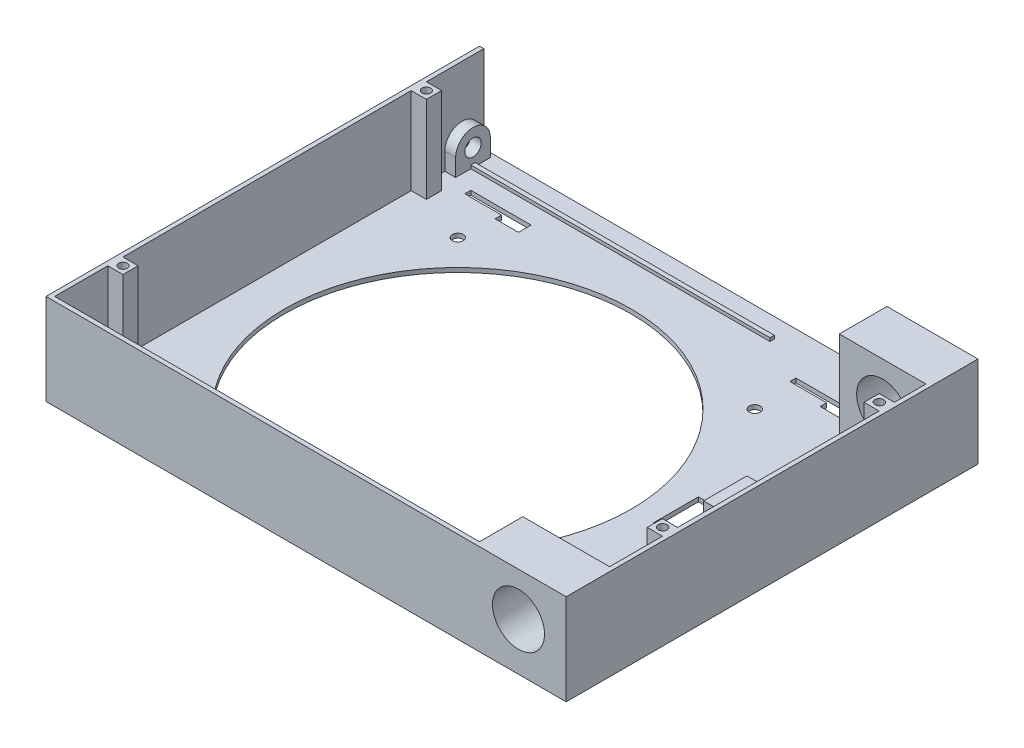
ISO-10303-21;
HEADER;
FILE_DESCRIPTION(('STEP AP214'),'2;1');
FILE_NAME('part.step','',(''),(''),'','','');
FILE_SCHEMA(('AUTOMOTIVE_DESIGN { 1 0 10303 214 1 1 1 1 }'));
ENDSEC;
DATA;
#1=APPLICATION_CONTEXT('core data for automotive mechanical design processes');
#2=APPLICATION_PROTOCOL_DEFINITION('international standard','automotive_design',2000,#1);
#3=PRODUCT_CONTEXT('',#1,'mechanical');
#4=PRODUCT('Part','Part','',(#3));
#5=PRODUCT_RELATED_PRODUCT_CATEGORY('part','',(#4));
#6=PRODUCT_DEFINITION_FORMATION('','',#4);
#7=PRODUCT_DEFINITION_CONTEXT('part definition',#1,'design');
#8=PRODUCT_DEFINITION('design','',#6,#7);
#9=PRODUCT_DEFINITION_SHAPE('','',#8);
#10=(LENGTH_UNIT() NAMED_UNIT(*) SI_UNIT(.MILLI.,.METRE.));
#11=(NAMED_UNIT(*) PLANE_ANGLE_UNIT() SI_UNIT($,.RADIAN.));
#12=(NAMED_UNIT(*) SI_UNIT($,.STERADIAN.) SOLID_ANGLE_UNIT());
#13=UNCERTAINTY_MEASURE_WITH_UNIT(LENGTH_MEASURE(1.E-05),#10,'distance_accuracy_value','');
#14=(GEOMETRIC_REPRESENTATION_CONTEXT(3) GLOBAL_UNCERTAINTY_ASSIGNED_CONTEXT((#13)) GLOBAL_UNIT_ASSIGNED_CONTEXT((#10,
#11,#12)) REPRESENTATION_CONTEXT('',''));
#15=CARTESIAN_POINT('',(0.,0.,0.));
#16=DIRECTION('',(0.,0.,1.));
#17=DIRECTION('',(1.,0.,0.));
#18=AXIS2_PLACEMENT_3D('',#15,#16,#17);
#19=CARTESIAN_POINT('',(0.,2.54,0.));
#20=DIRECTION('',(0.,1.,0.));
#21=DIRECTION('',(0.,0.,1.));
#22=AXIS2_PLACEMENT_3D('',#19,#20,#21);
#23=PLANE('',#22);
#24=DIRECTION('',(0.,0.,1.));
#25=VECTOR('',#24,1.);
#26=CARTESIAN_POINT('',(-2.54000000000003,2.54,-21.8045662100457));
#27=LINE('',#26,#25);
#28=CARTESIAN_POINT('',(-2.54000000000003,2.54,-21.8045662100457));
#29=VERTEX_POINT('',#28);
#30=CARTESIAN_POINT('',(-2.54000000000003,2.54,6.13543378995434));
#31=VERTEX_POINT('',#30);
#32=EDGE_CURVE('E1152',#29,#31,#27,.T.);
#33=ORIENTED_EDGE('',*,*,#32,.F.);
#34=DIRECTION('',(1.,0.,0.));
#35=VECTOR('',#34,1.);
#36=CARTESIAN_POINT('',(50.8,2.54,-21.8045662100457));
#37=LINE('',#36,#35);
#38=CARTESIAN_POINT('',(-17.78,2.54,-21.8045662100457));
#39=VERTEX_POINT('',#38);
#40=EDGE_CURVE('E1319',#39,#29,#37,.T.);
#41=ORIENTED_EDGE('',*,*,#40,.F.);
#42=DIRECTION('',(0.,0.,1.));
#43=VECTOR('',#42,1.);
#44=CARTESIAN_POINT('',(-17.78,2.54,-31.9645662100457));
#45=LINE('',#44,#43);
#46=CARTESIAN_POINT('',(-17.78,2.54,-34.5045662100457));
#47=VERTEX_POINT('',#46);
#48=EDGE_CURVE('E550',#47,#39,#45,.T.);
#49=ORIENTED_EDGE('',*,*,#48,.F.);
#50=DIRECTION('',(-1.,0.,0.));
#51=VECTOR('',#50,1.);
#52=CARTESIAN_POINT('',(0.,2.54,-34.5045662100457));
#53=LINE('',#52,#51);
#54=CARTESIAN_POINT('',(-251.46,2.54,-34.5045662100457));
#55=VERTEX_POINT('',#54);
#56=EDGE_CURVE('E1265',#47,#55,#53,.T.);
#57=ORIENTED_EDGE('',*,*,#56,.T.);
#58=DIRECTION('',(0.,0.,-1.));
#59=VECTOR('',#58,1.);
#60=CARTESIAN_POINT('',(-251.46,2.54,-31.9645662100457));
#61=LINE('',#60,#59);
#62=CARTESIAN_POINT('',(-251.46,2.54,-31.9645662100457));
#63=VERTEX_POINT('',#62);
#64=EDGE_CURVE('E1189',#63,#55,#61,.T.);
#65=ORIENTED_EDGE('',*,*,#64,.F.);
#66=DIRECTION('',(-1.,0.,0.));
#67=VECTOR('',#66,1.);
#68=CARTESIAN_POINT('',(-245.11,2.54,-31.9645662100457));
#69=LINE('',#68,#67);
#70=CARTESIAN_POINT('',(-245.11,2.54,-31.9645662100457));
#71=VERTEX_POINT('',#70);
#72=EDGE_CURVE('E1248',#71,#63,#69,.T.);
#73=ORIENTED_EDGE('',*,*,#72,.F.);
#74=DIRECTION('',(0.,0.,-1.));
#75=VECTOR('',#74,1.);
#76=CARTESIAN_POINT('',(-245.11,2.54,-11.6445662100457));
#77=LINE('',#76,#75);
#78=CARTESIAN_POINT('',(-245.11,2.54,-23.0745662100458));
#79=VERTEX_POINT('',#78);
#80=EDGE_CURVE('E565',#79,#71,#77,.T.);
#81=ORIENTED_EDGE('',*,*,#80,.F.);
#82=DIRECTION('',(1.,0.,0.));
#83=VECTOR('',#82,1.);
#84=CARTESIAN_POINT('',(0.,2.54,-23.0745662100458));
#85=LINE('',#84,#83);
#86=CARTESIAN_POINT('',(-69.85,2.54,-23.0745662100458));
#87=VERTEX_POINT('',#86);
#88=EDGE_CURVE('E554',#79,#87,#85,.T.);
#89=ORIENTED_EDGE('',*,*,#88,.T.);
#90=DIRECTION('',(0.,0.,1.));
#91=VECTOR('',#90,1.);
#92=CARTESIAN_POINT('',(-69.85,2.54,-11.6445662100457));
#93=LINE('',#92,#91);
#94=CARTESIAN_POINT('',(-69.85,2.54,-20.5345662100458));
#95=VERTEX_POINT('',#94);
#96=EDGE_CURVE('E539',#87,#95,#93,.T.);
#97=ORIENTED_EDGE('',*,*,#96,.T.);
#98=DIRECTION('',(-1.,0.,0.));
#99=VECTOR('',#98,1.);
#100=CARTESIAN_POINT('',(0.,2.54,-20.5345662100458));
#101=LINE('',#100,#99);
#102=CARTESIAN_POINT('',(-245.11,2.54,-20.5345662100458));
#103=VERTEX_POINT('',#102);
#104=EDGE_CURVE('E567',#95,#103,#101,.T.);
#105=ORIENTED_EDGE('',*,*,#104,.T.);
#106=CARTESIAN_POINT('',(-245.11,2.54,-11.6445662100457));
#107=VERTEX_POINT('',#106);
#108=EDGE_CURVE('E1245',#107,#103,#77,.T.);
#109=ORIENTED_EDGE('',*,*,#108,.F.);
#110=DIRECTION('',(1.,0.,0.));
#111=VECTOR('',#110,1.);
#112=CARTESIAN_POINT('',(-245.11,2.54,-11.6445662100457));
#113=LINE('',#112,#111);
#114=CARTESIAN_POINT('',(-251.46,2.54,-11.6445662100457));
#115=VERTEX_POINT('',#114);
#116=EDGE_CURVE('E1251',#115,#107,#113,.T.);
#117=ORIENTED_EDGE('',*,*,#116,.F.);
#118=CARTESIAN_POINT('',(-251.46,2.54,-0.84956621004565));
#119=VERTEX_POINT('',#118);
#120=EDGE_CURVE('E1288',#119,#115,#61,.T.);
#121=ORIENTED_EDGE('',*,*,#120,.F.);
#122=DIRECTION('',(-1.,0.,0.));
#123=VECTOR('',#122,1.);
#124=CARTESIAN_POINT('',(-251.46,2.54,-0.849566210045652));
#125=LINE('',#124,#123);
#126=CARTESIAN_POINT('',(-242.57,2.54,-0.849566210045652));
#127=VERTEX_POINT('',#126);
#128=EDGE_CURVE('E1129',#127,#119,#125,.T.);
#129=ORIENTED_EDGE('',*,*,#128,.F.);
#130=DIRECTION('',(0.,0.,-1.));
#131=VECTOR('',#130,1.);
#132=CARTESIAN_POINT('',(-242.57,2.54,8.04043378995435));
#133=LINE('',#132,#131);
#134=CARTESIAN_POINT('',(-242.57,2.54,8.04043378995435));
#135=VERTEX_POINT('',#134);
#136=EDGE_CURVE('E1137',#135,#127,#133,.T.);
#137=ORIENTED_EDGE('',*,*,#136,.F.);
#138=DIRECTION('',(1.,0.,0.));
#139=VECTOR('',#138,1.);
#140=CARTESIAN_POINT('',(-251.46,2.54,8.04043378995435));
#141=LINE('',#140,#139);
#142=CARTESIAN_POINT('',(-251.46,2.54,8.04043378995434));
#143=VERTEX_POINT('',#142);
#144=EDGE_CURVE('E1125',#143,#135,#141,.T.);
#145=ORIENTED_EDGE('',*,*,#144,.F.);
#146=CARTESIAN_POINT('',(-251.46,2.54,176.950433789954));
#147=VERTEX_POINT('',#146);
#148=EDGE_CURVE('E1192',#147,#143,#61,.T.);
#149=ORIENTED_EDGE('',*,*,#148,.F.);
#150=DIRECTION('',(-1.,0.,0.));
#151=VECTOR('',#150,1.);
#152=CARTESIAN_POINT('',(-251.46,2.54,176.950433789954));
#153=LINE('',#152,#151);
#154=CARTESIAN_POINT('',(-242.57,2.54,176.950433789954));
#155=VERTEX_POINT('',#154);
#156=EDGE_CURVE('E1102',#155,#147,#153,.T.);
#157=ORIENTED_EDGE('',*,*,#156,.F.);
#158=DIRECTION('',(0.,0.,-1.));
#159=VECTOR('',#158,1.);
#160=CARTESIAN_POINT('',(-242.57,2.54,185.840433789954));
#161=LINE('',#160,#159);
#162=CARTESIAN_POINT('',(-242.57,2.54,185.840433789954));
#163=VERTEX_POINT('',#162);
#164=EDGE_CURVE('E1109',#163,#155,#161,.T.);
#165=ORIENTED_EDGE('',*,*,#164,.F.);
#166=DIRECTION('',(1.,0.,0.));
#167=VECTOR('',#166,1.);
#168=CARTESIAN_POINT('',(-251.46,2.54,185.840433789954));
#169=LINE('',#168,#167);
#170=CARTESIAN_POINT('',(-251.46,2.54,185.840433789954));
#171=VERTEX_POINT('',#170);
#172=EDGE_CURVE('E1098',#171,#163,#169,.T.);
#173=ORIENTED_EDGE('',*,*,#172,.F.);
#174=CARTESIAN_POINT('',(-251.46,2.54,216.955433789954));
#175=VERTEX_POINT('',#174);
#176=EDGE_CURVE('E1157',#175,#171,#61,.T.);
#177=ORIENTED_EDGE('',*,*,#176,.F.);
#178=DIRECTION('',(-1.,0.,0.));
#179=VECTOR('',#178,1.);
#180=CARTESIAN_POINT('',(-251.46,2.54,216.955433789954));
#181=LINE('',#180,#179);
#182=CARTESIAN_POINT('',(-2.54,2.54,216.955433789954));
#183=VERTEX_POINT('',#182);
#184=EDGE_CURVE('E1185',#183,#175,#181,.T.);
#185=ORIENTED_EDGE('',*,*,#184,.F.);
#186=DIRECTION('',(0.,0.,1.));
#187=VECTOR('',#186,1.);
#188=CARTESIAN_POINT('',(-2.54,2.54,191.555433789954));
#189=LINE('',#188,#187);
#190=CARTESIAN_POINT('',(-2.54,2.54,191.555433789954));
#191=VERTEX_POINT('',#190);
#192=EDGE_CURVE('E1323',#191,#183,#189,.T.);
#193=ORIENTED_EDGE('',*,*,#192,.F.);
#194=DIRECTION('',(-1.,0.,0.));
#195=VECTOR('',#194,1.);
#196=CARTESIAN_POINT('',(48.26,2.54,191.555433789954));
#197=LINE('',#196,#195);
#198=CARTESIAN_POINT('',(48.26,2.54,191.555433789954));
#199=VERTEX_POINT('',#198);
#200=EDGE_CURVE('E1357',#199,#191,#197,.T.);
#201=ORIENTED_EDGE('',*,*,#200,.F.);
#202=DIRECTION('',(0.,0.,1.));
#203=VECTOR('',#202,1.);
#204=CARTESIAN_POINT('',(48.26,2.54,-19.2645662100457));
#205=LINE('',#204,#203);
#206=CARTESIAN_POINT('',(48.26,2.54,160.567433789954));
#207=VERTEX_POINT('',#206);
#208=EDGE_CURVE('E1182',#207,#199,#205,.T.);
#209=ORIENTED_EDGE('',*,*,#208,.F.);
#210=DIRECTION('',(1.,0.,0.));
#211=VECTOR('',#210,1.);
#212=CARTESIAN_POINT('',(48.26,2.54,160.567433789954));
#213=LINE('',#212,#211);
#214=CARTESIAN_POINT('',(39.37,2.54,160.567433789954));
#215=VERTEX_POINT('',#214);
#216=EDGE_CURVE('E1045',#215,#207,#213,.T.);
#217=ORIENTED_EDGE('',*,*,#216,.F.);
#218=DIRECTION('',(0.,0.,1.));
#219=VECTOR('',#218,1.);
#220=CARTESIAN_POINT('',(39.37,2.54,151.677433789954));
#221=LINE('',#220,#219);
#222=CARTESIAN_POINT('',(39.37,2.54,151.677433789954));
#223=VERTEX_POINT('',#222);
#224=EDGE_CURVE('E1052',#223,#215,#221,.T.);
#225=ORIENTED_EDGE('',*,*,#224,.F.);
#226=DIRECTION('',(-1.,0.,0.));
#227=VECTOR('',#226,1.);
#228=CARTESIAN_POINT('',(48.26,2.54,151.677433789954));
#229=LINE('',#228,#227);
#230=CARTESIAN_POINT('',(48.26,2.54,151.677433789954));
#231=VERTEX_POINT('',#230);
#232=EDGE_CURVE('E1041',#231,#223,#229,.T.);
#233=ORIENTED_EDGE('',*,*,#232,.F.);
#234=CARTESIAN_POINT('',(48.26,2.54,105.195433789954));
#235=VERTEX_POINT('',#234);
#236=EDGE_CURVE('E1187',#235,#231,#205,.T.);
#237=ORIENTED_EDGE('',*,*,#236,.F.);
#238=DIRECTION('',(1.,0.,0.));
#239=VECTOR('',#238,1.);
#240=CARTESIAN_POINT('',(48.26,2.54,105.195433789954));
#241=LINE('',#240,#239);
#242=CARTESIAN_POINT('',(17.018,2.54,105.195433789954));
#243=VERTEX_POINT('',#242);
#244=EDGE_CURVE('E2256',#243,#235,#241,.T.);
#245=ORIENTED_EDGE('',*,*,#244,.F.);
#246=DIRECTION('',(0.,0.,-1.));
#247=VECTOR('',#246,1.);
#248=CARTESIAN_POINT('',(17.0180000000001,2.54,79.2874337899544));
#249=LINE('',#248,#247);
#250=CARTESIAN_POINT('',(17.0180000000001,2.54,105.703433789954));
#251=VERTEX_POINT('',#250);
#252=EDGE_CURVE('E963',#251,#243,#249,.T.);
#253=ORIENTED_EDGE('',*,*,#252,.F.);
#254=DIRECTION('',(1.,0.,0.));
#255=VECTOR('',#254,1.);
#256=CARTESIAN_POINT('',(-11.9379999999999,2.54,105.703433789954));
#257=LINE('',#256,#255);
#258=CARTESIAN_POINT('',(-11.9379999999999,2.54,105.703433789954));
#259=VERTEX_POINT('',#258);
#260=EDGE_CURVE('E959',#259,#251,#257,.T.);
#261=ORIENTED_EDGE('',*,*,#260,.F.);
#262=DIRECTION('',(0.,0.,1.));
#263=VECTOR('',#262,1.);
#264=CARTESIAN_POINT('',(-11.9379999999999,2.54,79.2874337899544));
#265=LINE('',#264,#263);
#266=CARTESIAN_POINT('',(-11.9379999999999,2.54,79.2874337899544));
#267=VERTEX_POINT('',#266);
#268=EDGE_CURVE('E792',#267,#259,#265,.T.);
#269=ORIENTED_EDGE('',*,*,#268,.F.);
#270=DIRECTION('',(-1.,0.,0.));
#271=VECTOR('',#270,1.);
#272=CARTESIAN_POINT('',(-11.9379999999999,2.54,79.2874337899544));
#273=LINE('',#272,#271);
#274=CARTESIAN_POINT('',(17.0180000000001,2.54,79.2874337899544));
#275=VERTEX_POINT('',#274);
#276=EDGE_CURVE('E948',#275,#267,#273,.T.);
#277=ORIENTED_EDGE('',*,*,#276,.F.);
#278=CARTESIAN_POINT('',(17.0180000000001,2.54,79.7954337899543));
#279=VERTEX_POINT('',#278);
#280=EDGE_CURVE('E962',#279,#275,#249,.T.);
#281=ORIENTED_EDGE('',*,*,#280,.F.);
#282=DIRECTION('',(-1.,0.,0.));
#283=VECTOR('',#282,1.);
#284=CARTESIAN_POINT('',(48.26,2.54,79.7954337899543));
#285=LINE('',#284,#283);
#286=CARTESIAN_POINT('',(48.26,2.54,79.7954337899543));
#287=VERTEX_POINT('',#286);
#288=EDGE_CURVE('E2253',#287,#279,#285,.T.);
#289=ORIENTED_EDGE('',*,*,#288,.F.);
#290=CARTESIAN_POINT('',(48.26,2.54,33.5674337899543));
#291=VERTEX_POINT('',#290);
#292=EDGE_CURVE('E1186',#291,#287,#205,.T.);
#293=ORIENTED_EDGE('',*,*,#292,.F.);
#294=DIRECTION('',(1.,0.,0.));
#295=VECTOR('',#294,1.);
#296=CARTESIAN_POINT('',(48.26,2.54,33.5674337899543));
#297=LINE('',#296,#295);
#298=CARTESIAN_POINT('',(39.37,2.54,33.5674337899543));
#299=VERTEX_POINT('',#298);
#300=EDGE_CURVE('E1073',#299,#291,#297,.T.);
#301=ORIENTED_EDGE('',*,*,#300,.F.);
#302=DIRECTION('',(0.,0.,1.));
#303=VECTOR('',#302,1.);
#304=CARTESIAN_POINT('',(39.37,2.54,24.6774337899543));
#305=LINE('',#304,#303);
#306=CARTESIAN_POINT('',(39.37,2.54,24.6774337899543));
#307=VERTEX_POINT('',#306);
#308=EDGE_CURVE('E1081',#307,#299,#305,.T.);
#309=ORIENTED_EDGE('',*,*,#308,.F.);
#310=DIRECTION('',(-1.,0.,0.));
#311=VECTOR('',#310,1.);
#312=CARTESIAN_POINT('',(48.26,2.54,24.6774337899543));
#313=LINE('',#312,#311);
#314=CARTESIAN_POINT('',(48.26,2.54,24.6774337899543));
#315=VERTEX_POINT('',#314);
#316=EDGE_CURVE('E1069',#315,#307,#313,.T.);
#317=ORIENTED_EDGE('',*,*,#316,.F.);
#318=CARTESIAN_POINT('',(48.26,2.54,6.13543378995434));
#319=VERTEX_POINT('',#318);
#320=EDGE_CURVE('E1183',#319,#315,#205,.T.);
#321=ORIENTED_EDGE('',*,*,#320,.F.);
#322=DIRECTION('',(1.,0.,0.));
#323=VECTOR('',#322,1.);
#324=CARTESIAN_POINT('',(-2.54000000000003,2.54,6.13543378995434));
#325=LINE('',#324,#323);
#326=EDGE_CURVE('E1322',#31,#319,#325,.T.);
#327=ORIENTED_EDGE('',*,*,#326,.F.);
#328=EDGE_LOOP('',(#33,#41,#49,#57,#65,#73,#81,#89,#97,#105,#109,#117,#121,#129,#137,#145,#149,
#157,#165,#173,#177,#185,#193,#201,#209,#217,#225,#233,#237,#245,#253,#261,#269,#277,#281,#289,
#293,#301,#309,#317,#321,#327));
#329=FACE_BOUND('',#328,.T.);
#330=DIRECTION('',(0.,0.,-1.));
#331=VECTOR('',#330,1.);
#332=CARTESIAN_POINT('',(-8.38199999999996,2.54,-9.61256621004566));
#333=LINE('',#332,#331);
#334=CARTESIAN_POINT('',(-8.38199999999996,2.54,-2.24656621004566));
#335=VERTEX_POINT('',#334);
#336=CARTESIAN_POINT('',(-8.38199999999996,2.54,-9.61256621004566));
#337=VERTEX_POINT('',#336);
#338=EDGE_CURVE('E900',#335,#337,#333,.T.);
#339=ORIENTED_EDGE('',*,*,#338,.F.);
#340=DIRECTION('',(1.,0.,0.));
#341=VECTOR('',#340,1.);
#342=CARTESIAN_POINT('',(-22.098,2.54,-2.24656621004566));
#343=LINE('',#342,#341);
#344=CARTESIAN_POINT('',(-22.098,2.54,-2.24656621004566));
#345=VERTEX_POINT('',#344);
#346=EDGE_CURVE('E929',#345,#335,#343,.T.);
#347=ORIENTED_EDGE('',*,*,#346,.F.);
#348=DIRECTION('',(0.,0.,1.));
#349=VECTOR('',#348,1.);
#350=CARTESIAN_POINT('',(-22.098,2.54,-6.05656621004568));
#351=LINE('',#350,#349);
#352=CARTESIAN_POINT('',(-22.098,2.54,-6.05656621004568));
#353=VERTEX_POINT('',#352);
#354=EDGE_CURVE('E926',#353,#345,#351,.T.);
#355=ORIENTED_EDGE('',*,*,#354,.F.);
#356=DIRECTION('',(1.,0.,0.));
#357=VECTOR('',#356,1.);
#358=CARTESIAN_POINT('',(-22.098,2.54,-6.05656621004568));
#359=LINE('',#358,#357);
#360=CARTESIAN_POINT('',(-43.688,2.54,-6.05656621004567));
#361=VERTEX_POINT('',#360);
#362=EDGE_CURVE('E923',#361,#353,#359,.T.);
#363=ORIENTED_EDGE('',*,*,#362,.F.);
#364=DIRECTION('',(0.,0.,1.));
#365=VECTOR('',#364,1.);
#366=CARTESIAN_POINT('',(-43.688,2.54,-9.61256621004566));
#367=LINE('',#366,#365);
#368=CARTESIAN_POINT('',(-43.688,2.54,-9.61256621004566));
#369=VERTEX_POINT('',#368);
#370=EDGE_CURVE('E919',#369,#361,#367,.T.);
#371=ORIENTED_EDGE('',*,*,#370,.F.);
#372=DIRECTION('',(-1.,0.,0.));
#373=VECTOR('',#372,1.);
#374=CARTESIAN_POINT('',(-21.59,2.54,-9.61256621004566));
#375=LINE('',#374,#373);
#376=EDGE_CURVE('E916',#337,#369,#375,.T.);
#377=ORIENTED_EDGE('',*,*,#376,.F.);
#378=EDGE_LOOP('',(#339,#347,#355,#363,#371,#377));
#379=FACE_BOUND('',#378,.T.);
#380=DIRECTION('',(0.,0.,-1.));
#381=VECTOR('',#380,1.);
#382=CARTESIAN_POINT('',(-8.382,2.54,203.747433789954));
#383=LINE('',#382,#381);
#384=CARTESIAN_POINT('',(-8.382,2.54,211.113433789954));
#385=VERTEX_POINT('',#384);
#386=CARTESIAN_POINT('',(-8.382,2.54,203.747433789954));
#387=VERTEX_POINT('',#386);
#388=EDGE_CURVE('E852',#385,#387,#383,.T.);
#389=ORIENTED_EDGE('',*,*,#388,.F.);
#390=DIRECTION('',(1.,0.,0.));
#391=VECTOR('',#390,1.);
#392=CARTESIAN_POINT('',(-22.098,2.54,211.113433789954));
#393=LINE('',#392,#391);
#394=CARTESIAN_POINT('',(-22.098,2.54,211.113433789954));
#395=VERTEX_POINT('',#394);
#396=EDGE_CURVE('E881',#395,#385,#393,.T.);
#397=ORIENTED_EDGE('',*,*,#396,.F.);
#398=DIRECTION('',(0.,0.,1.));
#399=VECTOR('',#398,1.);
#400=CARTESIAN_POINT('',(-22.098,2.54,207.303433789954));
#401=LINE('',#400,#399);
#402=CARTESIAN_POINT('',(-22.098,2.54,207.303433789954));
#403=VERTEX_POINT('',#402);
#404=EDGE_CURVE('E878',#403,#395,#401,.T.);
#405=ORIENTED_EDGE('',*,*,#404,.F.);
#406=DIRECTION('',(1.,0.,0.));
#407=VECTOR('',#406,1.);
#408=CARTESIAN_POINT('',(-22.098,2.54,207.303433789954));
#409=LINE('',#408,#407);
#410=CARTESIAN_POINT('',(-42.418,2.54,207.303433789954));
#411=VERTEX_POINT('',#410);
#412=EDGE_CURVE('E875',#411,#403,#409,.T.);
#413=ORIENTED_EDGE('',*,*,#412,.F.);
#414=DIRECTION('',(0.,0.,1.));
#415=VECTOR('',#414,1.);
#416=CARTESIAN_POINT('',(-42.418,2.54,203.747433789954));
#417=LINE('',#416,#415);
#418=CARTESIAN_POINT('',(-42.418,2.54,203.747433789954));
#419=VERTEX_POINT('',#418);
#420=EDGE_CURVE('E871',#419,#411,#417,.T.);
#421=ORIENTED_EDGE('',*,*,#420,.F.);
#422=DIRECTION('',(-1.,0.,0.));
#423=VECTOR('',#422,1.);
#424=CARTESIAN_POINT('',(-21.59,2.54,203.747433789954));
#425=LINE('',#424,#423);
#426=EDGE_CURVE('E868',#387,#419,#425,.T.);
#427=ORIENTED_EDGE('',*,*,#426,.F.);
#428=EDGE_LOOP('',(#389,#397,#405,#413,#421,#427));
#429=FACE_BOUND('',#428,.T.);
#430=DIRECTION('',(0.,0.,1.));
#431=VECTOR('',#430,1.);
#432=CARTESIAN_POINT('',(-234.188,2.54,203.747433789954));
#433=LINE('',#432,#431);
#434=CARTESIAN_POINT('',(-234.188,2.54,203.747433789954));
#435=VERTEX_POINT('',#434);
#436=CARTESIAN_POINT('',(-234.188,2.54,207.303433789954));
#437=VERTEX_POINT('',#436);
#438=EDGE_CURVE('E818',#435,#437,#433,.T.);
#439=ORIENTED_EDGE('',*,*,#438,.F.);
#440=DIRECTION('',(-1.,0.,0.));
#441=VECTOR('',#440,1.);
#442=CARTESIAN_POINT('',(-234.188,2.54,203.747433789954));
#443=LINE('',#442,#441);
#444=CARTESIAN_POINT('',(-198.882,2.54,203.747433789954));
#445=VERTEX_POINT('',#444);
#446=EDGE_CURVE('E802',#445,#435,#443,.T.);
#447=ORIENTED_EDGE('',*,*,#446,.F.);
#448=DIRECTION('',(0.,0.,-1.));
#449=VECTOR('',#448,1.);
#450=CARTESIAN_POINT('',(-198.882,2.54,203.747433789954));
#451=LINE('',#450,#449);
#452=CARTESIAN_POINT('',(-198.882,2.54,211.113433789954));
#453=VERTEX_POINT('',#452);
#454=EDGE_CURVE('E830',#453,#445,#451,.T.);
#455=ORIENTED_EDGE('',*,*,#454,.F.);
#456=DIRECTION('',(1.,0.,0.));
#457=VECTOR('',#456,1.);
#458=CARTESIAN_POINT('',(-212.598,2.54,211.113433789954));
#459=LINE('',#458,#457);
#460=CARTESIAN_POINT('',(-212.598,2.54,211.113433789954));
#461=VERTEX_POINT('',#460);
#462=EDGE_CURVE('E827',#461,#453,#459,.T.);
#463=ORIENTED_EDGE('',*,*,#462,.F.);
#464=DIRECTION('',(0.,0.,1.));
#465=VECTOR('',#464,1.);
#466=CARTESIAN_POINT('',(-212.598,2.54,207.303433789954));
#467=LINE('',#466,#465);
#468=CARTESIAN_POINT('',(-212.598,2.54,207.303433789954));
#469=VERTEX_POINT('',#468);
#470=EDGE_CURVE('E824',#469,#461,#467,.T.);
#471=ORIENTED_EDGE('',*,*,#470,.F.);
#472=DIRECTION('',(1.,0.,0.));
#473=VECTOR('',#472,1.);
#474=CARTESIAN_POINT('',(-234.188,2.54,207.303433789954));
#475=LINE('',#474,#473);
#476=EDGE_CURVE('E820',#437,#469,#475,.T.);
#477=ORIENTED_EDGE('',*,*,#476,.F.);
#478=EDGE_LOOP('',(#439,#447,#455,#463,#471,#477));
#479=FACE_BOUND('',#478,.T.);
#480=DIRECTION('',(0.,0.,1.));
#481=VECTOR('',#480,1.);
#482=CARTESIAN_POINT('',(-234.188,2.54,-6.05656621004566));
#483=LINE('',#482,#481);
#484=CARTESIAN_POINT('',(-234.188,2.54,-9.61256621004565));
#485=VERTEX_POINT('',#484);
#486=CARTESIAN_POINT('',(-234.188,2.54,-6.05656621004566));
#487=VERTEX_POINT('',#486);
#488=EDGE_CURVE('E837',#485,#487,#483,.T.);
#489=ORIENTED_EDGE('',*,*,#488,.F.);
#490=DIRECTION('',(-1.,0.,0.));
#491=VECTOR('',#490,1.);
#492=CARTESIAN_POINT('',(-234.188,2.54,-9.61256621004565));
#493=LINE('',#492,#491);
#494=CARTESIAN_POINT('',(-198.882,2.54,-9.61256621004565));
#495=VERTEX_POINT('',#494);
#496=EDGE_CURVE('E980',#495,#485,#493,.T.);
#497=ORIENTED_EDGE('',*,*,#496,.F.);
#498=DIRECTION('',(0.,0.,-1.));
#499=VECTOR('',#498,1.);
#500=CARTESIAN_POINT('',(-198.882,2.54,-9.61256621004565));
#501=LINE('',#500,#499);
#502=CARTESIAN_POINT('',(-198.882,2.54,-2.24656621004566));
#503=VERTEX_POINT('',#502);
#504=EDGE_CURVE('E1006',#503,#495,#501,.T.);
#505=ORIENTED_EDGE('',*,*,#504,.F.);
#506=DIRECTION('',(1.,0.,0.));
#507=VECTOR('',#506,1.);
#508=CARTESIAN_POINT('',(-212.598,2.54,-2.24656621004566));
#509=LINE('',#508,#507);
#510=CARTESIAN_POINT('',(-212.598,2.54,-2.24656621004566));
#511=VERTEX_POINT('',#510);
#512=EDGE_CURVE('E1003',#511,#503,#509,.T.);
#513=ORIENTED_EDGE('',*,*,#512,.F.);
#514=DIRECTION('',(0.,0.,1.));
#515=VECTOR('',#514,1.);
#516=CARTESIAN_POINT('',(-212.598,2.54,-6.05656621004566));
#517=LINE('',#516,#515);
#518=CARTESIAN_POINT('',(-212.598,2.54,-6.05656621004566));
#519=VERTEX_POINT('',#518);
#520=EDGE_CURVE('E1000',#519,#511,#517,.T.);
#521=ORIENTED_EDGE('',*,*,#520,.F.);
#522=DIRECTION('',(1.,0.,0.));
#523=VECTOR('',#522,1.);
#524=CARTESIAN_POINT('',(-234.188,2.54,-6.05656621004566));
#525=LINE('',#524,#523);
#526=EDGE_CURVE('E997',#487,#519,#525,.T.);
#527=ORIENTED_EDGE('',*,*,#526,.F.);
#528=EDGE_LOOP('',(#489,#497,#505,#513,#521,#527));
#529=FACE_BOUND('',#528,.T.);
#530=CARTESIAN_POINT('',(-213.995,2.54,192.190433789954));
#531=DIRECTION('',(0.,1.,0.));
#532=DIRECTION('',(0.,0.,1.));
#533=AXIS2_PLACEMENT_3D('',#530,#531,#532);
#534=CIRCLE('',#533,3.17499999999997);
#535=CARTESIAN_POINT('',(-213.995,2.54,195.365433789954));
#536=VERTEX_POINT('',#535);
#537=EDGE_CURVE('E1206',#536,#536,#534,.T.);
#538=ORIENTED_EDGE('',*,*,#537,.F.);
#539=EDGE_LOOP('',(#538));
#540=FACE_BOUND('',#539,.T.);
#541=CARTESIAN_POINT('',(-40.005,2.54,192.190433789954));
#542=DIRECTION('',(0.,1.,0.));
#543=DIRECTION('',(0.,0.,1.));
#544=AXIS2_PLACEMENT_3D('',#541,#542,#543);
#545=CIRCLE('',#544,3.175);
#546=CARTESIAN_POINT('',(-40.005,2.54,195.365433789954));
#547=VERTEX_POINT('',#546);
#548=EDGE_CURVE('E1213',#547,#547,#545,.T.);
#549=ORIENTED_EDGE('',*,*,#548,.F.);
#550=EDGE_LOOP('',(#549));
#551=FACE_BOUND('',#550,.T.);
#552=CARTESIAN_POINT('',(-40.0050000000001,2.54,18.2004337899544));
#553=DIRECTION('',(0.,1.,0.));
#554=DIRECTION('',(0.,0.,1.));
#555=AXIS2_PLACEMENT_3D('',#552,#553,#554);
#556=CIRCLE('',#555,3.175);
#557=CARTESIAN_POINT('',(-40.0050000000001,2.54,21.3754337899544));
#558=VERTEX_POINT('',#557);
#559=EDGE_CURVE('E1210',#558,#558,#556,.T.);
#560=ORIENTED_EDGE('',*,*,#559,.F.);
#561=EDGE_LOOP('',(#560));
#562=FACE_BOUND('',#561,.T.);
#563=CARTESIAN_POINT('',(-213.995,2.54,18.2004337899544));
#564=DIRECTION('',(0.,1.,0.));
#565=DIRECTION('',(0.,0.,1.));
#566=AXIS2_PLACEMENT_3D('',#563,#564,#565);
#567=CIRCLE('',#566,3.175);
#568=CARTESIAN_POINT('',(-213.995,2.54,21.3754337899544));
#569=VERTEX_POINT('',#568);
#570=EDGE_CURVE('E1207',#569,#569,#567,.T.);
#571=ORIENTED_EDGE('',*,*,#570,.F.);
#572=EDGE_LOOP('',(#571));
#573=FACE_BOUND('',#572,.T.);
#574=CARTESIAN_POINT('',(-127.,2.54,105.195433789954));
#575=DIRECTION('',(0.,1.,0.));
#576=DIRECTION('',(0.,0.,1.));
#577=AXIS2_PLACEMENT_3D('',#574,#575,#576);
#578=CIRCLE('',#577,101.6);
#579=CARTESIAN_POINT('',(-127.,2.54,206.795433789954));
#580=VERTEX_POINT('',#579);
#581=EDGE_CURVE('E579',#580,#580,#578,.T.);
#582=ORIENTED_EDGE('',*,*,#581,.F.);
#583=EDGE_LOOP('',(#582));
#584=FACE_BOUND('',#583,.T.);
#585=ADVANCED_FACE('F77',(#329,#379,#429,#479,#529,#540,#551,#562,#573,#584),#23,.T.);
#586=CARTESIAN_POINT('',(48.26,53.34,-19.2645662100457));
#587=DIRECTION('',(1.,0.,0.));
#588=DIRECTION('',(0.,0.,-1.));
#589=AXIS2_PLACEMENT_3D('',#586,#587,#588);
#590=PLANE('',#589);
#591=DIRECTION('',(0.,-1.,0.));
#592=VECTOR('',#591,1.);
#593=CARTESIAN_POINT('',(48.26,27.94,79.7954337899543));
#594=LINE('',#593,#592);
#595=CARTESIAN_POINT('',(48.26,27.94,79.7954337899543));
#596=VERTEX_POINT('',#595);
#597=EDGE_CURVE('E2278',#596,#287,#594,.T.);
#598=ORIENTED_EDGE('',*,*,#597,.F.);
#599=DIRECTION('',(0.,0.,-1.));
#600=VECTOR('',#599,1.);
#601=CARTESIAN_POINT('',(48.26,27.94,79.7954337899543));
#602=LINE('',#601,#600);
#603=CARTESIAN_POINT('',(48.26,27.94,105.195433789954));
#604=VERTEX_POINT('',#603);
#605=EDGE_CURVE('E2262',#604,#596,#602,.T.);
#606=ORIENTED_EDGE('',*,*,#605,.F.);
#607=DIRECTION('',(0.,-1.,0.));
#608=VECTOR('',#607,1.);
#609=CARTESIAN_POINT('',(48.26,27.94,105.195433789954));
#610=LINE('',#609,#608);
#611=EDGE_CURVE('E2270',#604,#235,#610,.T.);
#612=ORIENTED_EDGE('',*,*,#611,.T.);
#613=ORIENTED_EDGE('',*,*,#236,.T.);
#614=DIRECTION('',(0.,-1.,0.));
#615=VECTOR('',#614,1.);
#616=CARTESIAN_POINT('',(48.26,53.34,151.677433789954));
#617=LINE('',#616,#615);
#618=CARTESIAN_POINT('',(48.26,53.34,151.677433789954));
#619=VERTEX_POINT('',#618);
#620=EDGE_CURVE('E1063',#619,#231,#617,.T.);
#621=ORIENTED_EDGE('',*,*,#620,.F.);
#622=DIRECTION('',(0.,0.,1.));
#623=VECTOR('',#622,1.);
#624=CARTESIAN_POINT('',(48.26,53.34,-19.2645662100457));
#625=LINE('',#624,#623);
#626=CARTESIAN_POINT('',(48.26,53.34,33.5674337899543));
#627=VERTEX_POINT('',#626);
#628=EDGE_CURVE('E1170',#627,#619,#625,.T.);
#629=ORIENTED_EDGE('',*,*,#628,.F.);
#630=DIRECTION('',(0.,-1.,0.));
#631=VECTOR('',#630,1.);
#632=CARTESIAN_POINT('',(48.26,53.34,33.5674337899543));
#633=LINE('',#632,#631);
#634=EDGE_CURVE('E1078',#627,#291,#633,.T.);
#635=ORIENTED_EDGE('',*,*,#634,.T.);
#636=ORIENTED_EDGE('',*,*,#292,.T.);
#637=EDGE_LOOP('',(#598,#606,#612,#613,#621,#629,#635,#636));
#638=FACE_BOUND('',#637,.T.);
#639=ADVANCED_FACE('F638',(#638),#590,.F.);
#640=DIRECTION('',(0.,-1.,0.));
#641=VECTOR('',#640,1.);
#642=CARTESIAN_POINT('',(48.26,2.54,191.555433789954));
#643=LINE('',#642,#641);
#644=CARTESIAN_POINT('',(48.26,53.34,191.555433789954));
#645=VERTEX_POINT('',#644);
#646=EDGE_CURVE('E1354',#645,#199,#643,.T.);
#647=ORIENTED_EDGE('',*,*,#646,.F.);
#648=CARTESIAN_POINT('',(48.26,53.34,160.567433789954));
#649=VERTEX_POINT('',#648);
#650=EDGE_CURVE('E1166',#649,#645,#625,.T.);
#651=ORIENTED_EDGE('',*,*,#650,.F.);
#652=DIRECTION('',(0.,-1.,0.));
#653=VECTOR('',#652,1.);
#654=CARTESIAN_POINT('',(48.26,53.34,160.567433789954));
#655=LINE('',#654,#653);
#656=EDGE_CURVE('E1050',#649,#207,#655,.T.);
#657=ORIENTED_EDGE('',*,*,#656,.T.);
#658=ORIENTED_EDGE('',*,*,#208,.T.);
#659=EDGE_LOOP('',(#647,#651,#657,#658));
#660=FACE_BOUND('',#659,.T.);
#661=ADVANCED_FACE('F642',(#660),#590,.F.);
#662=CARTESIAN_POINT('',(-251.46,53.34,216.955433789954));
#663=DIRECTION('',(0.,0.,1.));
#664=DIRECTION('',(1.,0.,0.));
#665=AXIS2_PLACEMENT_3D('',#662,#663,#664);
#666=PLANE('',#665);
#667=DIRECTION('',(0.,1.,0.));
#668=VECTOR('',#667,1.);
#669=CARTESIAN_POINT('',(-2.54,2.54,216.955433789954));
#670=LINE('',#669,#668);
#671=CARTESIAN_POINT('',(-2.53999999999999,53.34,216.955433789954));
#672=VERTEX_POINT('',#671);
#673=EDGE_CURVE('E1358',#183,#672,#670,.T.);
#674=ORIENTED_EDGE('',*,*,#673,.F.);
#675=ORIENTED_EDGE('',*,*,#184,.T.);
#676=DIRECTION('',(0.,-1.,0.));
#677=VECTOR('',#676,1.);
#678=CARTESIAN_POINT('',(-251.46,53.34,216.955433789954));
#679=LINE('',#678,#677);
#680=CARTESIAN_POINT('',(-251.46,53.34,216.955433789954));
#681=VERTEX_POINT('',#680);
#682=EDGE_CURVE('E1195',#681,#175,#679,.T.);
#683=ORIENTED_EDGE('',*,*,#682,.F.);
#684=DIRECTION('',(-1.,0.,0.));
#685=VECTOR('',#684,1.);
#686=CARTESIAN_POINT('',(-251.46,53.34,216.955433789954));
#687=LINE('',#686,#685);
#688=EDGE_CURVE('E1169',#672,#681,#687,.T.);
#689=ORIENTED_EDGE('',*,*,#688,.F.);
#690=EDGE_LOOP('',(#674,#675,#683,#689));
#691=FACE_BOUND('',#690,.T.);
#692=ADVANCED_FACE('F705',(#691),#666,.F.);
#693=DIRECTION('',(0.,1.,0.));
#694=VECTOR('',#693,1.);
#695=CARTESIAN_POINT('',(48.26,2.54,6.13543378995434));
#696=LINE('',#695,#694);
#697=CARTESIAN_POINT('',(48.26,53.34,6.13543378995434));
#698=VERTEX_POINT('',#697);
#699=EDGE_CURVE('E1318',#319,#698,#696,.T.);
#700=ORIENTED_EDGE('',*,*,#699,.F.);
#701=ORIENTED_EDGE('',*,*,#320,.T.);
#702=DIRECTION('',(0.,-1.,0.));
#703=VECTOR('',#702,1.);
#704=CARTESIAN_POINT('',(48.26,53.34,24.6774337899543));
#705=LINE('',#704,#703);
#706=CARTESIAN_POINT('',(48.26,53.34,24.6774337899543));
#707=VERTEX_POINT('',#706);
#708=EDGE_CURVE('E1093',#707,#315,#705,.T.);
#709=ORIENTED_EDGE('',*,*,#708,.F.);
#710=EDGE_CURVE('E1167',#698,#707,#625,.T.);
#711=ORIENTED_EDGE('',*,*,#710,.F.);
#712=EDGE_LOOP('',(#700,#701,#709,#711));
#713=FACE_BOUND('',#712,.T.);
#714=ADVANCED_FACE('F645',(#713),#590,.F.);
#715=CARTESIAN_POINT('',(-251.46,53.34,-31.9645662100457));
#716=DIRECTION('',(-1.,0.,0.));
#717=DIRECTION('',(0.,0.,1.));
#718=AXIS2_PLACEMENT_3D('',#715,#716,#717);
#719=PLANE('',#718);
#720=DIRECTION('',(0.,-1.,0.));
#721=VECTOR('',#720,1.);
#722=CARTESIAN_POINT('',(-251.46,53.34,185.840433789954));
#723=LINE('',#722,#721);
#724=CARTESIAN_POINT('',(-251.46,53.34,185.840433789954));
#725=VERTEX_POINT('',#724);
#726=EDGE_CURVE('E1120',#725,#171,#723,.T.);
#727=ORIENTED_EDGE('',*,*,#726,.F.);
#728=DIRECTION('',(0.,0.,-1.));
#729=VECTOR('',#728,1.);
#730=CARTESIAN_POINT('',(-251.46,53.34,-31.9645662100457));
#731=LINE('',#730,#729);
#732=EDGE_CURVE('E1173',#681,#725,#731,.T.);
#733=ORIENTED_EDGE('',*,*,#732,.F.);
#734=ORIENTED_EDGE('',*,*,#682,.T.);
#735=ORIENTED_EDGE('',*,*,#176,.T.);
#736=EDGE_LOOP('',(#727,#733,#734,#735));
#737=FACE_BOUND('',#736,.T.);
#738=ADVANCED_FACE('F700',(#737),#719,.F.);
#739=DIRECTION('',(0.,-1.,0.));
#740=VECTOR('',#739,1.);
#741=CARTESIAN_POINT('',(-251.46,53.34,176.950433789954));
#742=LINE('',#741,#740);
#743=CARTESIAN_POINT('',(-251.46,53.34,176.950433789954));
#744=VERTEX_POINT('',#743);
#745=EDGE_CURVE('E1107',#744,#147,#742,.T.);
#746=ORIENTED_EDGE('',*,*,#745,.T.);
#747=ORIENTED_EDGE('',*,*,#148,.T.);
#748=DIRECTION('',(0.,-1.,0.));
#749=VECTOR('',#748,1.);
#750=CARTESIAN_POINT('',(-251.46,53.34,8.04043378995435));
#751=LINE('',#750,#749);
#752=CARTESIAN_POINT('',(-251.46,53.34,8.04043378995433));
#753=VERTEX_POINT('',#752);
#754=EDGE_CURVE('E1149',#753,#143,#751,.T.);
#755=ORIENTED_EDGE('',*,*,#754,.F.);
#756=EDGE_CURVE('E1177',#744,#753,#731,.T.);
#757=ORIENTED_EDGE('',*,*,#756,.F.);
#758=EDGE_LOOP('',(#746,#747,#755,#757));
#759=FACE_BOUND('',#758,.T.);
#760=ADVANCED_FACE('F703',(#759),#719,.F.);
#761=DIRECTION('',(0.,-1.,0.));
#762=VECTOR('',#761,1.);
#763=CARTESIAN_POINT('',(-251.46,53.34,-0.849566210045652));
#764=LINE('',#763,#762);
#765=CARTESIAN_POINT('',(-251.46,53.34,-0.849566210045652));
#766=VERTEX_POINT('',#765);
#767=EDGE_CURVE('E1134',#766,#119,#764,.T.);
#768=ORIENTED_EDGE('',*,*,#767,.T.);
#769=ORIENTED_EDGE('',*,*,#120,.T.);
#770=DIRECTION('',(0.,-1.,0.));
#771=VECTOR('',#770,1.);
#772=CARTESIAN_POINT('',(-251.46,22.86,-11.6445662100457));
#773=LINE('',#772,#771);
#774=CARTESIAN_POINT('',(-251.46,12.7,-11.6445662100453));
#775=VERTEX_POINT('',#774);
#776=EDGE_CURVE('E1256',#775,#115,#773,.T.);
#777=ORIENTED_EDGE('',*,*,#776,.F.);
#778=CARTESIAN_POINT('',(-251.46,12.7,-21.8045662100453));
#779=DIRECTION('',(-1.,0.,0.));
#780=DIRECTION('',(0.,0.,1.));
#781=AXIS2_PLACEMENT_3D('',#778,#779,#780);
#782=CIRCLE('',#781,10.16);
#783=CARTESIAN_POINT('',(-251.46,12.7,-31.9645662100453));
#784=VERTEX_POINT('',#783);
#785=EDGE_CURVE('E1238',#775,#784,#782,.T.);
#786=ORIENTED_EDGE('',*,*,#785,.T.);
#787=DIRECTION('',(0.,-1.,0.));
#788=VECTOR('',#787,1.);
#789=CARTESIAN_POINT('',(-251.46,22.86,-31.9645662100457));
#790=LINE('',#789,#788);
#791=EDGE_CURVE('E1259',#784,#63,#790,.T.);
#792=ORIENTED_EDGE('',*,*,#791,.T.);
#793=ORIENTED_EDGE('',*,*,#64,.T.);
#794=DIRECTION('',(0.,-1.,0.));
#795=VECTOR('',#794,1.);
#796=CARTESIAN_POINT('',(-251.46,53.34,-34.5045662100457));
#797=LINE('',#796,#795);
#798=CARTESIAN_POINT('',(-251.46,53.34,-34.5045662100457));
#799=VERTEX_POINT('',#798);
#800=EDGE_CURVE('E1180',#799,#55,#797,.T.);
#801=ORIENTED_EDGE('',*,*,#800,.F.);
#802=EDGE_CURVE('E1172',#766,#799,#731,.T.);
#803=ORIENTED_EDGE('',*,*,#802,.F.);
#804=EDGE_LOOP('',(#768,#769,#777,#786,#792,#793,#801,#803));
#805=FACE_BOUND('',#804,.T.);
#806=ADVANCED_FACE('F770',(#805),#719,.F.);
#807=CARTESIAN_POINT('',(-245.11,22.86,-11.6445662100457));
#808=DIRECTION('',(-1.,0.,0.));
#809=DIRECTION('',(0.,0.,1.));
#810=AXIS2_PLACEMENT_3D('',#807,#808,#809);
#811=PLANE('',#810);
#812=CARTESIAN_POINT('',(-245.11,12.7,-21.8045662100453));
#813=DIRECTION('',(-1.,0.,0.));
#814=DIRECTION('',(0.,0.,1.));
#815=AXIS2_PLACEMENT_3D('',#812,#813,#814);
#816=CIRCLE('',#815,4.82599999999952);
#817=CARTESIAN_POINT('',(-245.11,12.7,-16.9785662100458));
#818=VERTEX_POINT('',#817);
#819=EDGE_CURVE('E1235',#818,#818,#816,.T.);
#820=ORIENTED_EDGE('',*,*,#819,.T.);
#821=EDGE_LOOP('',(#820));
#822=FACE_BOUND('',#821,.T.);
#823=DIRECTION('',(0.,1.,0.));
#824=VECTOR('',#823,1.);
#825=CARTESIAN_POINT('',(-245.11,22.86,-23.0745662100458));
#826=LINE('',#825,#824);
#827=CARTESIAN_POINT('',(-245.11,4.445,-23.0745662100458));
#828=VERTEX_POINT('',#827);
#829=EDGE_CURVE('E1233',#79,#828,#826,.T.);
#830=ORIENTED_EDGE('',*,*,#829,.F.);
#831=ORIENTED_EDGE('',*,*,#80,.T.);
#832=DIRECTION('',(0.,-1.,0.));
#833=VECTOR('',#832,1.);
#834=CARTESIAN_POINT('',(-245.11,22.86,-31.9645662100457));
#835=LINE('',#834,#833);
#836=CARTESIAN_POINT('',(-245.11,12.7,-31.9645662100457));
#837=VERTEX_POINT('',#836);
#838=EDGE_CURVE('E1261',#837,#71,#835,.T.);
#839=ORIENTED_EDGE('',*,*,#838,.F.);
#840=CARTESIAN_POINT('',(-245.11,12.7,-21.8045662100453));
#841=DIRECTION('',(-1.,0.,0.));
#842=DIRECTION('',(0.,0.,1.));
#843=AXIS2_PLACEMENT_3D('',#840,#841,#842);
#844=CIRCLE('',#843,10.16);
#845=CARTESIAN_POINT('',(-245.11,12.7,-11.6445662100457));
#846=VERTEX_POINT('',#845);
#847=EDGE_CURVE('E1243',#846,#837,#844,.T.);
#848=ORIENTED_EDGE('',*,*,#847,.F.);
#849=DIRECTION('',(0.,-1.,0.));
#850=VECTOR('',#849,1.);
#851=CARTESIAN_POINT('',(-245.11,22.86,-11.6445662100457));
#852=LINE('',#851,#850);
#853=EDGE_CURVE('E1254',#846,#107,#852,.T.);
#854=ORIENTED_EDGE('',*,*,#853,.T.);
#855=ORIENTED_EDGE('',*,*,#108,.T.);
#856=DIRECTION('',(0.,-1.,0.));
#857=VECTOR('',#856,1.);
#858=CARTESIAN_POINT('',(-245.11,22.86,-20.5345662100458));
#859=LINE('',#858,#857);
#860=CARTESIAN_POINT('',(-245.11,4.445,-20.5345662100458));
#861=VERTEX_POINT('',#860);
#862=EDGE_CURVE('E1231',#861,#103,#859,.T.);
#863=ORIENTED_EDGE('',*,*,#862,.F.);
#864=DIRECTION('',(0.,0.,1.));
#865=VECTOR('',#864,1.);
#866=CARTESIAN_POINT('',(-245.11,4.445,-11.6445662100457));
#867=LINE('',#866,#865);
#868=EDGE_CURVE('E566',#828,#861,#867,.T.);
#869=ORIENTED_EDGE('',*,*,#868,.F.);
#870=EDGE_LOOP('',(#830,#831,#839,#848,#854,#855,#863,#869));
#871=FACE_BOUND('',#870,.T.);
#872=ADVANCED_FACE('F767',(#822,#871),#811,.F.);
#873=CARTESIAN_POINT('',(-245.11,22.86,-31.9645662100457));
#874=DIRECTION('',(0.,0.,1.));
#875=DIRECTION('',(1.,0.,0.));
#876=AXIS2_PLACEMENT_3D('',#873,#874,#875);
#877=PLANE('',#876);
#878=DIRECTION('',(-1.,0.,0.));
#879=VECTOR('',#878,1.);
#880=CARTESIAN_POINT('',(-63.5,12.7,-31.9645662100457));
#881=LINE('',#880,#879);
#882=EDGE_CURVE('E1240',#837,#784,#881,.T.);
#883=ORIENTED_EDGE('',*,*,#882,.F.);
#884=ORIENTED_EDGE('',*,*,#838,.T.);
#885=ORIENTED_EDGE('',*,*,#72,.T.);
#886=ORIENTED_EDGE('',*,*,#791,.F.);
#887=EDGE_LOOP('',(#883,#884,#885,#886));
#888=FACE_BOUND('',#887,.T.);
#889=ADVANCED_FACE('F764',(#888),#877,.F.);
#890=CARTESIAN_POINT('',(0.,2.54,-34.5045662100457));
#891=DIRECTION('',(0.,0.,1.));
#892=DIRECTION('',(1.,0.,0.));
#893=AXIS2_PLACEMENT_3D('',#890,#891,#892);
#894=PLANE('',#893);
#895=ORIENTED_EDGE('',*,*,#56,.F.);
#896=DIRECTION('',(0.,1.,0.));
#897=VECTOR('',#896,1.);
#898=CARTESIAN_POINT('',(-17.78,0.,-34.5045662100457));
#899=LINE('',#898,#897);
#900=CARTESIAN_POINT('',(-17.78,0.,-34.5045662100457));
#901=VERTEX_POINT('',#900);
#902=EDGE_CURVE('E782',#901,#47,#899,.T.);
#903=ORIENTED_EDGE('',*,*,#902,.F.);
#904=DIRECTION('',(-1.,0.,0.));
#905=VECTOR('',#904,1.);
#906=CARTESIAN_POINT('',(0.,0.,-34.5045662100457));
#907=LINE('',#906,#905);
#908=CARTESIAN_POINT('',(-254.,0.,-34.5045662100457));
#909=VERTEX_POINT('',#908);
#910=EDGE_CURVE('E1264',#901,#909,#907,.T.);
#911=ORIENTED_EDGE('',*,*,#910,.T.);
#912=DIRECTION('',(0.,-1.,0.));
#913=VECTOR('',#912,1.);
#914=CARTESIAN_POINT('',(-254.,2.54,-34.5045662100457));
#915=LINE('',#914,#913);
#916=CARTESIAN_POINT('',(-254.,53.34,-34.5045662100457));
#917=VERTEX_POINT('',#916);
#918=EDGE_CURVE('E1275',#917,#909,#915,.T.);
#919=ORIENTED_EDGE('',*,*,#918,.F.);
#920=DIRECTION('',(-1.,0.,0.));
#921=VECTOR('',#920,1.);
#922=CARTESIAN_POINT('',(-254.,53.34,-34.5045662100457));
#923=LINE('',#922,#921);
#924=EDGE_CURVE('E1176',#799,#917,#923,.T.);
#925=ORIENTED_EDGE('',*,*,#924,.F.);
#926=ORIENTED_EDGE('',*,*,#800,.T.);
#927=EDGE_LOOP('',(#895,#903,#911,#919,#925,#926));
#928=FACE_BOUND('',#927,.T.);
#929=ADVANCED_FACE('F79',(#928),#894,.F.);
#930=CARTESIAN_POINT('',(-254.,2.54,219.495433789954));
#931=DIRECTION('',(1.,0.,0.));
#932=DIRECTION('',(0.,0.,-1.));
#933=AXIS2_PLACEMENT_3D('',#930,#931,#932);
#934=PLANE('',#933);
#935=DIRECTION('',(0.,0.,1.));
#936=VECTOR('',#935,1.);
#937=CARTESIAN_POINT('',(-254.,0.,219.495433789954));
#938=LINE('',#937,#936);
#939=CARTESIAN_POINT('',(-254.,0.,219.495433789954));
#940=VERTEX_POINT('',#939);
#941=EDGE_CURVE('E1270',#909,#940,#938,.T.);
#942=ORIENTED_EDGE('',*,*,#941,.T.);
#943=DIRECTION('',(0.,-1.,0.));
#944=VECTOR('',#943,1.);
#945=CARTESIAN_POINT('',(-254.,2.54,219.495433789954));
#946=LINE('',#945,#944);
#947=CARTESIAN_POINT('',(-254.,53.34,219.495433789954));
#948=VERTEX_POINT('',#947);
#949=EDGE_CURVE('E1267',#948,#940,#946,.T.);
#950=ORIENTED_EDGE('',*,*,#949,.F.);
#951=DIRECTION('',(0.,0.,1.));
#952=VECTOR('',#951,1.);
#953=CARTESIAN_POINT('',(-254.,53.34,-34.5045662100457));
#954=LINE('',#953,#952);
#955=EDGE_CURVE('E1153',#917,#948,#954,.T.);
#956=ORIENTED_EDGE('',*,*,#955,.F.);
#957=ORIENTED_EDGE('',*,*,#918,.T.);
#958=EDGE_LOOP('',(#942,#950,#956,#957));
#959=FACE_BOUND('',#958,.T.);
#960=ADVANCED_FACE('F1296',(#959),#934,.F.);
#961=CARTESIAN_POINT('',(0.,2.54,219.495433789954));
#962=DIRECTION('',(0.,0.,-1.));
#963=DIRECTION('',(-1.,0.,0.));
#964=AXIS2_PLACEMENT_3D('',#961,#962,#963);
#965=PLANE('',#964);
#966=CARTESIAN_POINT('',(22.86,27.94,219.495433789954));
#967=DIRECTION('',(0.,0.,-1.));
#968=DIRECTION('',(-1.,0.,0.));
#969=AXIS2_PLACEMENT_3D('',#966,#967,#968);
#970=CIRCLE('',#969,15.24);
#971=CARTESIAN_POINT('',(7.62,27.94,219.495433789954));
#972=VERTEX_POINT('',#971);
#973=EDGE_CURVE('E1362',#972,#972,#970,.F.);
#974=ORIENTED_EDGE('',*,*,#973,.F.);
#975=EDGE_LOOP('',(#974));
#976=FACE_BOUND('',#975,.T.);
#977=DIRECTION('',(1.,0.,0.));
#978=VECTOR('',#977,1.);
#979=CARTESIAN_POINT('',(0.,0.,219.495433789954));
#980=LINE('',#979,#978);
#981=CARTESIAN_POINT('',(50.8,0.,219.495433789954));
#982=VERTEX_POINT('',#981);
#983=EDGE_CURVE('E1268',#940,#982,#980,.T.);
#984=ORIENTED_EDGE('',*,*,#983,.T.);
#985=DIRECTION('',(0.,-1.,0.));
#986=VECTOR('',#985,1.);
#987=CARTESIAN_POINT('',(50.8,0.,219.495433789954));
#988=LINE('',#987,#986);
#989=CARTESIAN_POINT('',(50.8,53.34,219.495433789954));
#990=VERTEX_POINT('',#989);
#991=EDGE_CURVE('E591',#990,#982,#988,.T.);
#992=ORIENTED_EDGE('',*,*,#991,.F.);
#993=DIRECTION('',(1.,0.,0.));
#994=VECTOR('',#993,1.);
#995=CARTESIAN_POINT('',(-254.,53.34,219.495433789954));
#996=LINE('',#995,#994);
#997=EDGE_CURVE('E1156',#948,#990,#996,.T.);
#998=ORIENTED_EDGE('',*,*,#997,.F.);
#999=ORIENTED_EDGE('',*,*,#949,.T.);
#1000=EDGE_LOOP('',(#984,#992,#998,#999));
#1001=FACE_BOUND('',#1000,.T.);
#1002=ADVANCED_FACE('F778',(#976,#1001),#965,.F.);
#1003=CARTESIAN_POINT('',(0.,0.,0.));
#1004=DIRECTION('',(0.,1.,0.));
#1005=DIRECTION('',(0.,0.,1.));
#1006=AXIS2_PLACEMENT_3D('',#1003,#1004,#1005);
#1007=PLANE('',#1006);
#1008=DIRECTION('',(-1.,0.,0.));
#1009=VECTOR('',#1008,1.);
#1010=CARTESIAN_POINT('',(-11.9379999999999,0.,79.2874337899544));
#1011=LINE('',#1010,#1009);
#1012=CARTESIAN_POINT('',(17.0180000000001,0.,79.2874337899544));
#1013=VERTEX_POINT('',#1012);
#1014=CARTESIAN_POINT('',(-11.9379999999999,0.,79.2874337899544));
#1015=VERTEX_POINT('',#1014);
#1016=EDGE_CURVE('E954',#1013,#1015,#1011,.T.);
#1017=ORIENTED_EDGE('',*,*,#1016,.T.);
#1018=DIRECTION('',(0.,0.,1.));
#1019=VECTOR('',#1018,1.);
#1020=CARTESIAN_POINT('',(-11.9379999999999,0.,79.2874337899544));
#1021=LINE('',#1020,#1019);
#1022=CARTESIAN_POINT('',(-11.9379999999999,0.,105.703433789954));
#1023=VERTEX_POINT('',#1022);
#1024=EDGE_CURVE('E944',#1015,#1023,#1021,.T.);
#1025=ORIENTED_EDGE('',*,*,#1024,.T.);
#1026=DIRECTION('',(1.,0.,0.));
#1027=VECTOR('',#1026,1.);
#1028=CARTESIAN_POINT('',(-11.9379999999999,0.,105.703433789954));
#1029=LINE('',#1028,#1027);
#1030=CARTESIAN_POINT('',(17.0180000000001,0.,105.703433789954));
#1031=VERTEX_POINT('',#1030);
#1032=EDGE_CURVE('E947',#1023,#1031,#1029,.T.);
#1033=ORIENTED_EDGE('',*,*,#1032,.T.);
#1034=DIRECTION('',(0.,0.,-1.));
#1035=VECTOR('',#1034,1.);
#1036=CARTESIAN_POINT('',(17.0180000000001,0.,79.2874337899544));
#1037=LINE('',#1036,#1035);
#1038=EDGE_CURVE('E951',#1031,#1013,#1037,.T.);
#1039=ORIENTED_EDGE('',*,*,#1038,.T.);
#1040=EDGE_LOOP('',(#1017,#1025,#1033,#1039));
#1041=FACE_BOUND('',#1040,.T.);
#1042=DIRECTION('',(1.,0.,0.));
#1043=VECTOR('',#1042,1.);
#1044=CARTESIAN_POINT('',(-22.098,0.,-2.24656621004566));
#1045=LINE('',#1044,#1043);
#1046=CARTESIAN_POINT('',(-22.098,0.,-2.24656621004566));
#1047=VERTEX_POINT('',#1046);
#1048=CARTESIAN_POINT('',(-8.38199999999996,0.,-2.24656621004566));
#1049=VERTEX_POINT('',#1048);
#1050=EDGE_CURVE('E909',#1047,#1049,#1045,.T.);
#1051=ORIENTED_EDGE('',*,*,#1050,.T.);
#1052=DIRECTION('',(0.,0.,-1.));
#1053=VECTOR('',#1052,1.);
#1054=CARTESIAN_POINT('',(-8.38199999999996,0.,-9.61256621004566));
#1055=LINE('',#1054,#1053);
#1056=CARTESIAN_POINT('',(-8.38199999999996,0.,-9.61256621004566));
#1057=VERTEX_POINT('',#1056);
#1058=EDGE_CURVE('E912',#1049,#1057,#1055,.T.);
#1059=ORIENTED_EDGE('',*,*,#1058,.T.);
#1060=DIRECTION('',(-1.,0.,0.));
#1061=VECTOR('',#1060,1.);
#1062=CARTESIAN_POINT('',(-21.59,0.,-9.61256621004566));
#1063=LINE('',#1062,#1061);
#1064=CARTESIAN_POINT('',(-43.688,0.,-9.61256621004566));
#1065=VERTEX_POINT('',#1064);
#1066=EDGE_CURVE('E896',#1057,#1065,#1063,.T.);
#1067=ORIENTED_EDGE('',*,*,#1066,.T.);
#1068=DIRECTION('',(0.,0.,1.));
#1069=VECTOR('',#1068,1.);
#1070=CARTESIAN_POINT('',(-43.688,0.,-9.61256621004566));
#1071=LINE('',#1070,#1069);
#1072=CARTESIAN_POINT('',(-43.688,0.,-6.05656621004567));
#1073=VERTEX_POINT('',#1072);
#1074=EDGE_CURVE('E899',#1065,#1073,#1071,.T.);
#1075=ORIENTED_EDGE('',*,*,#1074,.T.);
#1076=DIRECTION('',(1.,0.,0.));
#1077=VECTOR('',#1076,1.);
#1078=CARTESIAN_POINT('',(-22.098,0.,-6.05656621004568));
#1079=LINE('',#1078,#1077);
#1080=CARTESIAN_POINT('',(-22.098,0.,-6.05656621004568));
#1081=VERTEX_POINT('',#1080);
#1082=EDGE_CURVE('E903',#1073,#1081,#1079,.T.);
#1083=ORIENTED_EDGE('',*,*,#1082,.T.);
#1084=DIRECTION('',(0.,0.,1.));
#1085=VECTOR('',#1084,1.);
#1086=CARTESIAN_POINT('',(-22.098,0.,-6.05656621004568));
#1087=LINE('',#1086,#1085);
#1088=EDGE_CURVE('E906',#1081,#1047,#1087,.T.);
#1089=ORIENTED_EDGE('',*,*,#1088,.T.);
#1090=EDGE_LOOP('',(#1051,#1059,#1067,#1075,#1083,#1089));
#1091=FACE_BOUND('',#1090,.T.);
#1092=DIRECTION('',(1.,0.,0.));
#1093=VECTOR('',#1092,1.);
#1094=CARTESIAN_POINT('',(-22.098,0.,211.113433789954));
#1095=LINE('',#1094,#1093);
#1096=CARTESIAN_POINT('',(-22.098,0.,211.113433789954));
#1097=VERTEX_POINT('',#1096);
#1098=CARTESIAN_POINT('',(-8.382,0.,211.113433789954));
#1099=VERTEX_POINT('',#1098);
#1100=EDGE_CURVE('E861',#1097,#1099,#1095,.T.);
#1101=ORIENTED_EDGE('',*,*,#1100,.T.);
#1102=DIRECTION('',(0.,0.,-1.));
#1103=VECTOR('',#1102,1.);
#1104=CARTESIAN_POINT('',(-8.382,0.,203.747433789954));
#1105=LINE('',#1104,#1103);
#1106=CARTESIAN_POINT('',(-8.382,0.,203.747433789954));
#1107=VERTEX_POINT('',#1106);
#1108=EDGE_CURVE('E864',#1099,#1107,#1105,.T.);
#1109=ORIENTED_EDGE('',*,*,#1108,.T.);
#1110=DIRECTION('',(-1.,0.,0.));
#1111=VECTOR('',#1110,1.);
#1112=CARTESIAN_POINT('',(-21.59,0.,203.747433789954));
#1113=LINE('',#1112,#1111);
#1114=CARTESIAN_POINT('',(-42.418,0.,203.747433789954));
#1115=VERTEX_POINT('',#1114);
#1116=EDGE_CURVE('E848',#1107,#1115,#1113,.T.);
#1117=ORIENTED_EDGE('',*,*,#1116,.T.);
#1118=DIRECTION('',(0.,0.,1.));
#1119=VECTOR('',#1118,1.);
#1120=CARTESIAN_POINT('',(-42.418,0.,203.747433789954));
#1121=LINE('',#1120,#1119);
#1122=CARTESIAN_POINT('',(-42.418,0.,207.303433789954));
#1123=VERTEX_POINT('',#1122);
#1124=EDGE_CURVE('E851',#1115,#1123,#1121,.T.);
#1125=ORIENTED_EDGE('',*,*,#1124,.T.);
#1126=DIRECTION('',(1.,0.,0.));
#1127=VECTOR('',#1126,1.);
#1128=CARTESIAN_POINT('',(-22.098,0.,207.303433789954));
#1129=LINE('',#1128,#1127);
#1130=CARTESIAN_POINT('',(-22.098,0.,207.303433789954));
#1131=VERTEX_POINT('',#1130);
#1132=EDGE_CURVE('E855',#1123,#1131,#1129,.T.);
#1133=ORIENTED_EDGE('',*,*,#1132,.T.);
#1134=DIRECTION('',(0.,0.,1.));
#1135=VECTOR('',#1134,1.);
#1136=CARTESIAN_POINT('',(-22.098,0.,207.303433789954));
#1137=LINE('',#1136,#1135);
#1138=EDGE_CURVE('E858',#1131,#1097,#1137,.T.);
#1139=ORIENTED_EDGE('',*,*,#1138,.T.);
#1140=EDGE_LOOP('',(#1101,#1109,#1117,#1125,#1133,#1139));
#1141=FACE_BOUND('',#1140,.T.);
#1142=DIRECTION('',(-1.,0.,0.));
#1143=VECTOR('',#1142,1.);
#1144=CARTESIAN_POINT('',(-212.09,0.,203.747433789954));
#1145=LINE('',#1144,#1143);
#1146=CARTESIAN_POINT('',(-198.882,0.,203.747433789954));
#1147=VERTEX_POINT('',#1146);
#1148=CARTESIAN_POINT('',(-234.188,0.,203.747433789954));
#1149=VERTEX_POINT('',#1148);
#1150=EDGE_CURVE('E814',#1147,#1149,#1145,.T.);
#1151=ORIENTED_EDGE('',*,*,#1150,.T.);
#1152=DIRECTION('',(0.,0.,1.));
#1153=VECTOR('',#1152,1.);
#1154=CARTESIAN_POINT('',(-234.188,0.,203.747433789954));
#1155=LINE('',#1154,#1153);
#1156=CARTESIAN_POINT('',(-234.188,0.,207.303433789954));
#1157=VERTEX_POINT('',#1156);
#1158=EDGE_CURVE('E798',#1149,#1157,#1155,.T.);
#1159=ORIENTED_EDGE('',*,*,#1158,.T.);
#1160=DIRECTION('',(1.,0.,0.));
#1161=VECTOR('',#1160,1.);
#1162=CARTESIAN_POINT('',(-234.188,0.,207.303433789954));
#1163=LINE('',#1162,#1161);
#1164=CARTESIAN_POINT('',(-212.598,0.,207.303433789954));
#1165=VERTEX_POINT('',#1164);
#1166=EDGE_CURVE('E801',#1157,#1165,#1163,.T.);
#1167=ORIENTED_EDGE('',*,*,#1166,.T.);
#1168=DIRECTION('',(0.,0.,1.));
#1169=VECTOR('',#1168,1.);
#1170=CARTESIAN_POINT('',(-212.598,0.,207.303433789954));
#1171=LINE('',#1170,#1169);
#1172=CARTESIAN_POINT('',(-212.598,0.,211.113433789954));
#1173=VERTEX_POINT('',#1172);
#1174=EDGE_CURVE('E805',#1165,#1173,#1171,.T.);
#1175=ORIENTED_EDGE('',*,*,#1174,.T.);
#1176=DIRECTION('',(1.,0.,0.));
#1177=VECTOR('',#1176,1.);
#1178=CARTESIAN_POINT('',(-212.598,0.,211.113433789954));
#1179=LINE('',#1178,#1177);
#1180=CARTESIAN_POINT('',(-198.882,0.,211.113433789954));
#1181=VERTEX_POINT('',#1180);
#1182=EDGE_CURVE('E808',#1173,#1181,#1179,.T.);
#1183=ORIENTED_EDGE('',*,*,#1182,.T.);
#1184=DIRECTION('',(0.,0.,-1.));
#1185=VECTOR('',#1184,1.);
#1186=CARTESIAN_POINT('',(-198.882,0.,203.747433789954));
#1187=LINE('',#1186,#1185);
#1188=EDGE_CURVE('E811',#1181,#1147,#1187,.T.);
#1189=ORIENTED_EDGE('',*,*,#1188,.T.);
#1190=EDGE_LOOP('',(#1151,#1159,#1167,#1175,#1183,#1189));
#1191=FACE_BOUND('',#1190,.T.);
#1192=DIRECTION('',(-1.,0.,0.));
#1193=VECTOR('',#1192,1.);
#1194=CARTESIAN_POINT('',(-215.9,0.,-9.61256621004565));
#1195=LINE('',#1194,#1193);
#1196=CARTESIAN_POINT('',(-198.882,0.,-9.61256621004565));
#1197=VERTEX_POINT('',#1196);
#1198=CARTESIAN_POINT('',(-234.188,0.,-9.61256621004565));
#1199=VERTEX_POINT('',#1198);
#1200=EDGE_CURVE('E992',#1197,#1199,#1195,.T.);
#1201=ORIENTED_EDGE('',*,*,#1200,.T.);
#1202=DIRECTION('',(0.,0.,1.));
#1203=VECTOR('',#1202,1.);
#1204=CARTESIAN_POINT('',(-234.188,0.,-6.05656621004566));
#1205=LINE('',#1204,#1203);
#1206=CARTESIAN_POINT('',(-234.188,0.,-6.05656621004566));
#1207=VERTEX_POINT('',#1206);
#1208=EDGE_CURVE('E976',#1199,#1207,#1205,.T.);
#1209=ORIENTED_EDGE('',*,*,#1208,.T.);
#1210=DIRECTION('',(1.,0.,0.));
#1211=VECTOR('',#1210,1.);
#1212=CARTESIAN_POINT('',(-234.188,0.,-6.05656621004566));
#1213=LINE('',#1212,#1211);
#1214=CARTESIAN_POINT('',(-212.598,0.,-6.05656621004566));
#1215=VERTEX_POINT('',#1214);
#1216=EDGE_CURVE('E979',#1207,#1215,#1213,.T.);
#1217=ORIENTED_EDGE('',*,*,#1216,.T.);
#1218=DIRECTION('',(0.,0.,1.));
#1219=VECTOR('',#1218,1.);
#1220=CARTESIAN_POINT('',(-212.598,0.,-6.05656621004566));
#1221=LINE('',#1220,#1219);
#1222=CARTESIAN_POINT('',(-212.598,0.,-2.24656621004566));
#1223=VERTEX_POINT('',#1222);
#1224=EDGE_CURVE('E983',#1215,#1223,#1221,.T.);
#1225=ORIENTED_EDGE('',*,*,#1224,.T.);
#1226=DIRECTION('',(1.,0.,0.));
#1227=VECTOR('',#1226,1.);
#1228=CARTESIAN_POINT('',(-212.598,0.,-2.24656621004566));
#1229=LINE('',#1228,#1227);
#1230=CARTESIAN_POINT('',(-198.882,0.,-2.24656621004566));
#1231=VERTEX_POINT('',#1230);
#1232=EDGE_CURVE('E986',#1223,#1231,#1229,.T.);
#1233=ORIENTED_EDGE('',*,*,#1232,.T.);
#1234=DIRECTION('',(0.,0.,-1.));
#1235=VECTOR('',#1234,1.);
#1236=CARTESIAN_POINT('',(-198.882,0.,-9.61256621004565));
#1237=LINE('',#1236,#1235);
#1238=EDGE_CURVE('E989',#1231,#1197,#1237,.T.);
#1239=ORIENTED_EDGE('',*,*,#1238,.T.);
#1240=EDGE_LOOP('',(#1201,#1209,#1217,#1225,#1233,#1239));
#1241=FACE_BOUND('',#1240,.T.);
#1242=CARTESIAN_POINT('',(-247.015,0.,3.59543378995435));
#1243=DIRECTION('',(0.,1.,0.));
#1244=DIRECTION('',(0.,0.,1.));
#1245=AXIS2_PLACEMENT_3D('',#1242,#1243,#1244);
#1246=CIRCLE('',#1245,2.53999999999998);
#1247=CARTESIAN_POINT('',(-247.015,0.,6.13543378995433));
#1248=VERTEX_POINT('',#1247);
#1249=EDGE_CURVE('E1037',#1248,#1248,#1246,.T.);
#1250=ORIENTED_EDGE('',*,*,#1249,.T.);
#1251=EDGE_LOOP('',(#1250));
#1252=FACE_BOUND('',#1251,.T.);
#1253=CARTESIAN_POINT('',(43.688,0.,28.9954337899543));
#1254=DIRECTION('',(0.,1.,0.));
#1255=DIRECTION('',(0.,0.,1.));
#1256=AXIS2_PLACEMENT_3D('',#1253,#1254,#1255);
#1257=CIRCLE('',#1256,2.54);
#1258=CARTESIAN_POINT('',(43.688,0.,31.5354337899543));
#1259=VERTEX_POINT('',#1258);
#1260=EDGE_CURVE('E1034',#1259,#1259,#1257,.T.);
#1261=ORIENTED_EDGE('',*,*,#1260,.T.);
#1262=EDGE_LOOP('',(#1261));
#1263=FACE_BOUND('',#1262,.T.);
#1264=CARTESIAN_POINT('',(43.688,0.,155.995433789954));
#1265=DIRECTION('',(0.,1.,0.));
#1266=DIRECTION('',(0.,0.,1.));
#1267=AXIS2_PLACEMENT_3D('',#1264,#1265,#1266);
#1268=CIRCLE('',#1267,2.54000000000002);
#1269=CARTESIAN_POINT('',(43.688,0.,158.535433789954));
#1270=VERTEX_POINT('',#1269);
#1271=EDGE_CURVE('E616',#1270,#1270,#1268,.T.);
#1272=ORIENTED_EDGE('',*,*,#1271,.T.);
#1273=EDGE_LOOP('',(#1272));
#1274=FACE_BOUND('',#1273,.T.);
#1275=CARTESIAN_POINT('',(-213.995,0.,192.190433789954));
#1276=DIRECTION('',(0.,1.,0.));
#1277=DIRECTION('',(0.,0.,1.));
#1278=AXIS2_PLACEMENT_3D('',#1275,#1276,#1277);
#1279=CIRCLE('',#1278,3.17499999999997);
#1280=CARTESIAN_POINT('',(-213.995,0.,195.365433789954));
#1281=VERTEX_POINT('',#1280);
#1282=EDGE_CURVE('E588',#1281,#1281,#1279,.T.);
#1283=ORIENTED_EDGE('',*,*,#1282,.T.);
#1284=EDGE_LOOP('',(#1283));
#1285=FACE_BOUND('',#1284,.T.);
#1286=CARTESIAN_POINT('',(-40.005,0.,192.190433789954));
#1287=DIRECTION('',(0.,1.,0.));
#1288=DIRECTION('',(0.,0.,1.));
#1289=AXIS2_PLACEMENT_3D('',#1286,#1287,#1288);
#1290=CIRCLE('',#1289,3.175);
#1291=CARTESIAN_POINT('',(-40.005,0.,195.365433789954));
#1292=VERTEX_POINT('',#1291);
#1293=EDGE_CURVE('E585',#1292,#1292,#1290,.T.);
#1294=ORIENTED_EDGE('',*,*,#1293,.T.);
#1295=EDGE_LOOP('',(#1294));
#1296=FACE_BOUND('',#1295,.T.);
#1297=CARTESIAN_POINT('',(-40.0050000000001,0.,18.2004337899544));
#1298=DIRECTION('',(0.,1.,0.));
#1299=DIRECTION('',(0.,0.,1.));
#1300=AXIS2_PLACEMENT_3D('',#1297,#1298,#1299);
#1301=CIRCLE('',#1300,3.175);
#1302=CARTESIAN_POINT('',(-40.0050000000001,0.,21.3754337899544));
#1303=VERTEX_POINT('',#1302);
#1304=EDGE_CURVE('E582',#1303,#1303,#1301,.T.);
#1305=ORIENTED_EDGE('',*,*,#1304,.T.);
#1306=EDGE_LOOP('',(#1305));
#1307=FACE_BOUND('',#1306,.T.);
#1308=CARTESIAN_POINT('',(-213.995,0.,18.2004337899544));
#1309=DIRECTION('',(0.,1.,0.));
#1310=DIRECTION('',(0.,0.,1.));
#1311=AXIS2_PLACEMENT_3D('',#1308,#1309,#1310);
#1312=CIRCLE('',#1311,3.175);
#1313=CARTESIAN_POINT('',(-213.995,0.,21.3754337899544));
#1314=VERTEX_POINT('',#1313);
#1315=EDGE_CURVE('E578',#1314,#1314,#1312,.T.);
#1316=ORIENTED_EDGE('',*,*,#1315,.T.);
#1317=EDGE_LOOP('',(#1316));
#1318=FACE_BOUND('',#1317,.T.);
#1319=CARTESIAN_POINT('',(-127.,0.,105.195433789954));
#1320=DIRECTION('',(0.,1.,0.));
#1321=DIRECTION('',(0.,0.,1.));
#1322=AXIS2_PLACEMENT_3D('',#1319,#1320,#1321);
#1323=CIRCLE('',#1322,101.6);
#1324=CARTESIAN_POINT('',(-127.,0.,206.795433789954));
#1325=VERTEX_POINT('',#1324);
#1326=EDGE_CURVE('E575',#1325,#1325,#1323,.T.);
#1327=ORIENTED_EDGE('',*,*,#1326,.T.);
#1328=EDGE_LOOP('',(#1327));
#1329=FACE_BOUND('',#1328,.T.);
#1330=DIRECTION('',(0.,0.,1.));
#1331=VECTOR('',#1330,1.);
#1332=CARTESIAN_POINT('',(-17.78,0.,-34.5045662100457));
#1333=LINE('',#1332,#1331);
#1334=CARTESIAN_POINT('',(-17.78,0.,-21.8045662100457));
#1335=VERTEX_POINT('',#1334);
#1336=EDGE_CURVE('E786',#901,#1335,#1333,.T.);
#1337=ORIENTED_EDGE('',*,*,#1336,.T.);
#1338=DIRECTION('',(1.,0.,0.));
#1339=VECTOR('',#1338,1.);
#1340=CARTESIAN_POINT('',(50.8,0.,-21.8045662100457));
#1341=LINE('',#1340,#1339);
#1342=CARTESIAN_POINT('',(50.8,0.,-21.8045662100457));
#1343=VERTEX_POINT('',#1342);
#1344=EDGE_CURVE('E790',#1335,#1343,#1341,.T.);
#1345=ORIENTED_EDGE('',*,*,#1344,.T.);
#1346=DIRECTION('',(0.,0.,-1.));
#1347=VECTOR('',#1346,1.);
#1348=CARTESIAN_POINT('',(50.8,0.,219.495433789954));
#1349=LINE('',#1348,#1347);
#1350=EDGE_CURVE('E559',#982,#1343,#1349,.T.);
#1351=ORIENTED_EDGE('',*,*,#1350,.F.);
#1352=ORIENTED_EDGE('',*,*,#983,.F.);
#1353=ORIENTED_EDGE('',*,*,#941,.F.);
#1354=ORIENTED_EDGE('',*,*,#910,.F.);
#1355=EDGE_LOOP('',(#1337,#1345,#1351,#1352,#1353,#1354));
#1356=FACE_BOUND('',#1355,.T.);
#1357=ADVANCED_FACE('F773',(#1041,#1091,#1141,#1191,#1241,#1252,#1263,#1274,#1285,#1296,#1307,
#1318,#1329,#1356),#1007,.F.);
#1358=CARTESIAN_POINT('',(-17.78,22.86,-31.9645662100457));
#1359=DIRECTION('',(-1.,0.,0.));
#1360=DIRECTION('',(0.,0.,1.));
#1361=AXIS2_PLACEMENT_3D('',#1358,#1359,#1360);
#1362=PLANE('',#1361);
#1363=ORIENTED_EDGE('',*,*,#902,.T.);
#1364=ORIENTED_EDGE('',*,*,#48,.T.);
#1365=DIRECTION('',(0.,1.,0.));
#1366=VECTOR('',#1365,1.);
#1367=CARTESIAN_POINT('',(-17.78,0.,-21.8045662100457));
#1368=LINE('',#1367,#1366);
#1369=EDGE_CURVE('E789',#1335,#39,#1368,.T.);
#1370=ORIENTED_EDGE('',*,*,#1369,.F.);
#1371=ORIENTED_EDGE('',*,*,#1336,.F.);
#1372=EDGE_LOOP('',(#1363,#1364,#1370,#1371));
#1373=FACE_BOUND('',#1372,.T.);
#1374=ADVANCED_FACE('F762',(#1373),#1362,.F.);
#1375=CARTESIAN_POINT('',(-245.11,22.86,-11.6445662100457));
#1376=DIRECTION('',(0.,0.,-1.));
#1377=DIRECTION('',(-1.,0.,0.));
#1378=AXIS2_PLACEMENT_3D('',#1375,#1376,#1377);
#1379=PLANE('',#1378);
#1380=ORIENTED_EDGE('',*,*,#853,.F.);
#1381=DIRECTION('',(-1.,0.,0.));
#1382=VECTOR('',#1381,1.);
#1383=CARTESIAN_POINT('',(-63.5,12.7,-11.6445662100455));
#1384=LINE('',#1383,#1382);
#1385=EDGE_CURVE('E571',#846,#775,#1384,.T.);
#1386=ORIENTED_EDGE('',*,*,#1385,.T.);
#1387=ORIENTED_EDGE('',*,*,#776,.T.);
#1388=ORIENTED_EDGE('',*,*,#116,.T.);
#1389=EDGE_LOOP('',(#1380,#1386,#1387,#1388));
#1390=FACE_BOUND('',#1389,.T.);
#1391=ADVANCED_FACE('F758',(#1390),#1379,.F.);
#1392=CARTESIAN_POINT('',(-63.5,12.7,-21.8045662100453));
#1393=DIRECTION('',(-1.,0.,0.));
#1394=DIRECTION('',(0.,0.,1.));
#1395=AXIS2_PLACEMENT_3D('',#1392,#1393,#1394);
#1396=CYLINDRICAL_SURFACE('',#1395,10.16);
#1397=ORIENTED_EDGE('',*,*,#847,.T.);
#1398=ORIENTED_EDGE('',*,*,#882,.T.);
#1399=ORIENTED_EDGE('',*,*,#785,.F.);
#1400=ORIENTED_EDGE('',*,*,#1385,.F.);
#1401=EDGE_LOOP('',(#1397,#1398,#1399,#1400));
#1402=FACE_BOUND('',#1401,.T.);
#1403=ADVANCED_FACE('F754',(#1402),#1396,.T.);
#1404=CARTESIAN_POINT('',(-63.5,12.7,-21.8045662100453));
#1405=DIRECTION('',(-1.,0.,0.));
#1406=DIRECTION('',(0.,0.,1.));
#1407=AXIS2_PLACEMENT_3D('',#1404,#1405,#1406);
#1408=CYLINDRICAL_SURFACE('',#1407,4.82599999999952);
#1409=CARTESIAN_POINT('',(-251.46,12.7,-21.8045662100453));
#1410=DIRECTION('',(-1.,0.,0.));
#1411=DIRECTION('',(0.,0.,1.));
#1412=AXIS2_PLACEMENT_3D('',#1409,#1410,#1411);
#1413=CIRCLE('',#1412,4.82599999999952);
#1414=CARTESIAN_POINT('',(-251.46,12.7,-16.9785662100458));
#1415=VERTEX_POINT('',#1414);
#1416=EDGE_CURVE('E1203',#1415,#1415,#1413,.F.);
#1417=ORIENTED_EDGE('',*,*,#1416,.F.);
#1418=EDGE_LOOP('',(#1417));
#1419=FACE_BOUND('',#1418,.T.);
#1420=ORIENTED_EDGE('',*,*,#819,.F.);
#1421=EDGE_LOOP('',(#1420));
#1422=FACE_BOUND('',#1421,.T.);
#1423=ADVANCED_FACE('F745',(#1419,#1422),#1408,.F.);
#1424=CARTESIAN_POINT('',(-250.19,4.445,-23.0745662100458));
#1425=DIRECTION('',(0.,-1.,0.));
#1426=DIRECTION('',(0.,0.,-1.));
#1427=AXIS2_PLACEMENT_3D('',#1424,#1425,#1426);
#1428=PLANE('',#1427);
#1429=DIRECTION('',(1.,0.,0.));
#1430=VECTOR('',#1429,1.);
#1431=CARTESIAN_POINT('',(-250.19,4.445,-23.0745662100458));
#1432=LINE('',#1431,#1430);
#1433=CARTESIAN_POINT('',(-69.85,4.445,-23.0745662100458));
#1434=VERTEX_POINT('',#1433);
#1435=EDGE_CURVE('E557',#828,#1434,#1432,.T.);
#1436=ORIENTED_EDGE('',*,*,#1435,.F.);
#1437=ORIENTED_EDGE('',*,*,#868,.T.);
#1438=DIRECTION('',(1.,0.,0.));
#1439=VECTOR('',#1438,1.);
#1440=CARTESIAN_POINT('',(-250.19,4.445,-20.5345662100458));
#1441=LINE('',#1440,#1439);
#1442=CARTESIAN_POINT('',(-69.85,4.445,-20.5345662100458));
#1443=VERTEX_POINT('',#1442);
#1444=EDGE_CURVE('E1228',#861,#1443,#1441,.T.);
#1445=ORIENTED_EDGE('',*,*,#1444,.T.);
#1446=DIRECTION('',(0.,0.,-1.));
#1447=VECTOR('',#1446,1.);
#1448=CARTESIAN_POINT('',(-69.85,4.445,-23.0745662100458));
#1449=LINE('',#1448,#1447);
#1450=EDGE_CURVE('E1225',#1443,#1434,#1449,.T.);
#1451=ORIENTED_EDGE('',*,*,#1450,.T.);
#1452=EDGE_LOOP('',(#1436,#1437,#1445,#1451));
#1453=FACE_BOUND('',#1452,.T.);
#1454=ADVANCED_FACE('F742',(#1453),#1428,.F.);
#1455=CARTESIAN_POINT('',(-250.19,2.54,-23.0745662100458));
#1456=DIRECTION('',(0.,0.,1.));
#1457=DIRECTION('',(1.,0.,0.));
#1458=AXIS2_PLACEMENT_3D('',#1455,#1456,#1457);
#1459=PLANE('',#1458);
#1460=ORIENTED_EDGE('',*,*,#88,.F.);
#1461=ORIENTED_EDGE('',*,*,#829,.T.);
#1462=ORIENTED_EDGE('',*,*,#1435,.T.);
#1463=DIRECTION('',(0.,-1.,0.));
#1464=VECTOR('',#1463,1.);
#1465=CARTESIAN_POINT('',(-69.85,2.54,-23.0745662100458));
#1466=LINE('',#1465,#1464);
#1467=EDGE_CURVE('E542',#1434,#87,#1466,.T.);
#1468=ORIENTED_EDGE('',*,*,#1467,.T.);
#1469=EDGE_LOOP('',(#1460,#1461,#1462,#1468));
#1470=FACE_BOUND('',#1469,.T.);
#1471=ADVANCED_FACE('F553',(#1470),#1459,.F.);
#1472=CARTESIAN_POINT('',(-250.19,2.54,-20.5345662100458));
#1473=DIRECTION('',(0.,0.,-1.));
#1474=DIRECTION('',(-1.,0.,0.));
#1475=AXIS2_PLACEMENT_3D('',#1472,#1473,#1474);
#1476=PLANE('',#1475);
#1477=ORIENTED_EDGE('',*,*,#1444,.F.);
#1478=ORIENTED_EDGE('',*,*,#862,.T.);
#1479=ORIENTED_EDGE('',*,*,#104,.F.);
#1480=DIRECTION('',(0.,1.,0.));
#1481=VECTOR('',#1480,1.);
#1482=CARTESIAN_POINT('',(-69.85,2.54,-20.5345662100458));
#1483=LINE('',#1482,#1481);
#1484=EDGE_CURVE('E545',#95,#1443,#1483,.T.);
#1485=ORIENTED_EDGE('',*,*,#1484,.T.);
#1486=EDGE_LOOP('',(#1477,#1478,#1479,#1485));
#1487=FACE_BOUND('',#1486,.T.);
#1488=ADVANCED_FACE('F740',(#1487),#1476,.F.);
#1489=CARTESIAN_POINT('',(50.8,0.,0.));
#1490=DIRECTION('',(-1.,0.,0.));
#1491=DIRECTION('',(0.,0.,1.));
#1492=AXIS2_PLACEMENT_3D('',#1489,#1490,#1491);
#1493=PLANE('',#1492);
#1494=ORIENTED_EDGE('',*,*,#1350,.T.);
#1495=DIRECTION('',(0.,-1.,0.));
#1496=VECTOR('',#1495,1.);
#1497=CARTESIAN_POINT('',(50.8,53.34,-21.8045662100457));
#1498=LINE('',#1497,#1496);
#1499=CARTESIAN_POINT('',(50.8,53.34,-21.8045662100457));
#1500=VERTEX_POINT('',#1499);
#1501=EDGE_CURVE('E1201',#1500,#1343,#1498,.T.);
#1502=ORIENTED_EDGE('',*,*,#1501,.F.);
#1503=DIRECTION('',(0.,0.,-1.));
#1504=VECTOR('',#1503,1.);
#1505=CARTESIAN_POINT('',(50.8,53.34,-19.2645662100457));
#1506=LINE('',#1505,#1504);
#1507=EDGE_CURVE('E1160',#990,#1500,#1506,.T.);
#1508=ORIENTED_EDGE('',*,*,#1507,.F.);
#1509=ORIENTED_EDGE('',*,*,#991,.T.);
#1510=EDGE_LOOP('',(#1494,#1502,#1508,#1509));
#1511=FACE_BOUND('',#1510,.T.);
#1512=ADVANCED_FACE('F736',(#1511),#1493,.F.);
#1513=CARTESIAN_POINT('',(-127.,-48.26,105.195433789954));
#1514=DIRECTION('',(0.,1.,0.));
#1515=DIRECTION('',(0.,0.,1.));
#1516=AXIS2_PLACEMENT_3D('',#1513,#1514,#1515);
#1517=CYLINDRICAL_SURFACE('',#1516,101.6);
#1518=ORIENTED_EDGE('',*,*,#581,.T.);
#1519=EDGE_LOOP('',(#1518));
#1520=FACE_BOUND('',#1519,.T.);
#1521=ORIENTED_EDGE('',*,*,#1326,.F.);
#1522=EDGE_LOOP('',(#1521));
#1523=FACE_BOUND('',#1522,.T.);
#1524=ADVANCED_FACE('F722',(#1520,#1523),#1517,.F.);
#1525=CARTESIAN_POINT('',(-213.995,-48.26,18.2004337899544));
#1526=DIRECTION('',(0.,1.,0.));
#1527=DIRECTION('',(0.,0.,1.));
#1528=AXIS2_PLACEMENT_3D('',#1525,#1526,#1527);
#1529=CYLINDRICAL_SURFACE('',#1528,3.175);
#1530=ORIENTED_EDGE('',*,*,#570,.T.);
#1531=EDGE_LOOP('',(#1530));
#1532=FACE_BOUND('',#1531,.T.);
#1533=ORIENTED_EDGE('',*,*,#1315,.F.);
#1534=EDGE_LOOP('',(#1533));
#1535=FACE_BOUND('',#1534,.T.);
#1536=ADVANCED_FACE('F718',(#1532,#1535),#1529,.F.);
#1537=CARTESIAN_POINT('',(-40.0050000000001,-48.26,18.2004337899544));
#1538=DIRECTION('',(0.,1.,0.));
#1539=DIRECTION('',(0.,0.,1.));
#1540=AXIS2_PLACEMENT_3D('',#1537,#1538,#1539);
#1541=CYLINDRICAL_SURFACE('',#1540,3.175);
#1542=ORIENTED_EDGE('',*,*,#559,.T.);
#1543=EDGE_LOOP('',(#1542));
#1544=FACE_BOUND('',#1543,.T.);
#1545=ORIENTED_EDGE('',*,*,#1304,.F.);
#1546=EDGE_LOOP('',(#1545));
#1547=FACE_BOUND('',#1546,.T.);
#1548=ADVANCED_FACE('F721',(#1544,#1547),#1541,.F.);
#1549=CARTESIAN_POINT('',(-40.005,-48.26,192.190433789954));
#1550=DIRECTION('',(0.,1.,0.));
#1551=DIRECTION('',(0.,0.,1.));
#1552=AXIS2_PLACEMENT_3D('',#1549,#1550,#1551);
#1553=CYLINDRICAL_SURFACE('',#1552,3.175);
#1554=ORIENTED_EDGE('',*,*,#548,.T.);
#1555=EDGE_LOOP('',(#1554));
#1556=FACE_BOUND('',#1555,.T.);
#1557=ORIENTED_EDGE('',*,*,#1293,.F.);
#1558=EDGE_LOOP('',(#1557));
#1559=FACE_BOUND('',#1558,.T.);
#1560=ADVANCED_FACE('F726',(#1556,#1559),#1553,.F.);
#1561=CARTESIAN_POINT('',(-213.995,-48.26,192.190433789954));
#1562=DIRECTION('',(0.,1.,0.));
#1563=DIRECTION('',(0.,0.,1.));
#1564=AXIS2_PLACEMENT_3D('',#1561,#1562,#1563);
#1565=CYLINDRICAL_SURFACE('',#1564,3.17499999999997);
#1566=ORIENTED_EDGE('',*,*,#537,.T.);
#1567=EDGE_LOOP('',(#1566));
#1568=FACE_BOUND('',#1567,.T.);
#1569=ORIENTED_EDGE('',*,*,#1282,.F.);
#1570=EDGE_LOOP('',(#1569));
#1571=FACE_BOUND('',#1570,.T.);
#1572=ADVANCED_FACE('F699',(#1568,#1571),#1565,.F.);
#1573=CARTESIAN_POINT('',(0.,53.34,0.));
#1574=DIRECTION('',(0.,1.,0.));
#1575=DIRECTION('',(0.,0.,1.));
#1576=AXIS2_PLACEMENT_3D('',#1573,#1574,#1575);
#1577=PLANE('',#1576);
#1578=DIRECTION('',(-1.,0.,0.));
#1579=VECTOR('',#1578,1.);
#1580=CARTESIAN_POINT('',(-2.54000000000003,53.34,6.13543378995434));
#1581=LINE('',#1580,#1579);
#1582=CARTESIAN_POINT('',(-2.54000000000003,53.34,6.13543378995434));
#1583=VERTEX_POINT('',#1582);
#1584=EDGE_CURVE('E1310',#698,#1583,#1581,.T.);
#1585=ORIENTED_EDGE('',*,*,#1584,.F.);
#1586=ORIENTED_EDGE('',*,*,#710,.T.);
#1587=DIRECTION('',(-1.,0.,0.));
#1588=VECTOR('',#1587,1.);
#1589=CARTESIAN_POINT('',(48.26,53.34,24.6774337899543));
#1590=LINE('',#1589,#1588);
#1591=CARTESIAN_POINT('',(39.37,53.34,24.6774337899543));
#1592=VERTEX_POINT('',#1591);
#1593=EDGE_CURVE('E1070',#707,#1592,#1590,.T.);
#1594=ORIENTED_EDGE('',*,*,#1593,.T.);
#1595=DIRECTION('',(0.,0.,1.));
#1596=VECTOR('',#1595,1.);
#1597=CARTESIAN_POINT('',(39.37,53.34,24.6774337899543));
#1598=LINE('',#1597,#1596);
#1599=CARTESIAN_POINT('',(39.37,53.34,33.5674337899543));
#1600=VERTEX_POINT('',#1599);
#1601=EDGE_CURVE('E1072',#1592,#1600,#1598,.T.);
#1602=ORIENTED_EDGE('',*,*,#1601,.T.);
#1603=DIRECTION('',(1.,0.,0.));
#1604=VECTOR('',#1603,1.);
#1605=CARTESIAN_POINT('',(48.26,53.34,33.5674337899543));
#1606=LINE('',#1605,#1604);
#1607=EDGE_CURVE('E1075',#1600,#627,#1606,.T.);
#1608=ORIENTED_EDGE('',*,*,#1607,.T.);
#1609=ORIENTED_EDGE('',*,*,#628,.T.);
#1610=DIRECTION('',(-1.,0.,0.));
#1611=VECTOR('',#1610,1.);
#1612=CARTESIAN_POINT('',(48.26,53.34,151.677433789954));
#1613=LINE('',#1612,#1611);
#1614=CARTESIAN_POINT('',(39.37,53.34,151.677433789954));
#1615=VERTEX_POINT('',#1614);
#1616=EDGE_CURVE('E1042',#619,#1615,#1613,.T.);
#1617=ORIENTED_EDGE('',*,*,#1616,.T.);
#1618=DIRECTION('',(0.,0.,1.));
#1619=VECTOR('',#1618,1.);
#1620=CARTESIAN_POINT('',(39.37,53.34,151.677433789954));
#1621=LINE('',#1620,#1619);
#1622=CARTESIAN_POINT('',(39.37,53.34,160.567433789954));
#1623=VERTEX_POINT('',#1622);
#1624=EDGE_CURVE('E1044',#1615,#1623,#1621,.T.);
#1625=ORIENTED_EDGE('',*,*,#1624,.T.);
#1626=DIRECTION('',(1.,0.,0.));
#1627=VECTOR('',#1626,1.);
#1628=CARTESIAN_POINT('',(48.26,53.34,160.567433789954));
#1629=LINE('',#1628,#1627);
#1630=EDGE_CURVE('E1047',#1623,#649,#1629,.T.);
#1631=ORIENTED_EDGE('',*,*,#1630,.T.);
#1632=ORIENTED_EDGE('',*,*,#650,.T.);
#1633=DIRECTION('',(1.,0.,0.));
#1634=VECTOR('',#1633,1.);
#1635=CARTESIAN_POINT('',(48.26,53.34,191.555433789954));
#1636=LINE('',#1635,#1634);
#1637=CARTESIAN_POINT('',(-2.54,53.34,191.555433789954));
#1638=VERTEX_POINT('',#1637);
#1639=EDGE_CURVE('E1348',#1638,#645,#1636,.T.);
#1640=ORIENTED_EDGE('',*,*,#1639,.F.);
#1641=DIRECTION('',(0.,0.,1.));
#1642=VECTOR('',#1641,1.);
#1643=CARTESIAN_POINT('',(-2.54,53.34,191.555433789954));
#1644=LINE('',#1643,#1642);
#1645=EDGE_CURVE('E101',#1638,#672,#1644,.T.);
#1646=ORIENTED_EDGE('',*,*,#1645,.T.);
#1647=ORIENTED_EDGE('',*,*,#688,.T.);
#1648=ORIENTED_EDGE('',*,*,#732,.T.);
#1649=DIRECTION('',(1.,0.,0.));
#1650=VECTOR('',#1649,1.);
#1651=CARTESIAN_POINT('',(-251.46,53.34,185.840433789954));
#1652=LINE('',#1651,#1650);
#1653=CARTESIAN_POINT('',(-242.57,53.34,185.840433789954));
#1654=VERTEX_POINT('',#1653);
#1655=EDGE_CURVE('E1099',#725,#1654,#1652,.T.);
#1656=ORIENTED_EDGE('',*,*,#1655,.T.);
#1657=DIRECTION('',(0.,0.,-1.));
#1658=VECTOR('',#1657,1.);
#1659=CARTESIAN_POINT('',(-242.57,53.34,185.840433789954));
#1660=LINE('',#1659,#1658);
#1661=CARTESIAN_POINT('',(-242.57,53.34,176.950433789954));
#1662=VERTEX_POINT('',#1661);
#1663=EDGE_CURVE('E1101',#1654,#1662,#1660,.T.);
#1664=ORIENTED_EDGE('',*,*,#1663,.T.);
#1665=DIRECTION('',(-1.,0.,0.));
#1666=VECTOR('',#1665,1.);
#1667=CARTESIAN_POINT('',(-251.46,53.34,176.950433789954));
#1668=LINE('',#1667,#1666);
#1669=EDGE_CURVE('E1104',#1662,#744,#1668,.T.);
#1670=ORIENTED_EDGE('',*,*,#1669,.T.);
#1671=ORIENTED_EDGE('',*,*,#756,.T.);
#1672=DIRECTION('',(1.,0.,0.));
#1673=VECTOR('',#1672,1.);
#1674=CARTESIAN_POINT('',(-251.46,53.34,8.04043378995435));
#1675=LINE('',#1674,#1673);
#1676=CARTESIAN_POINT('',(-242.57,53.34,8.04043378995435));
#1677=VERTEX_POINT('',#1676);
#1678=EDGE_CURVE('E1126',#753,#1677,#1675,.T.);
#1679=ORIENTED_EDGE('',*,*,#1678,.T.);
#1680=DIRECTION('',(0.,0.,-1.));
#1681=VECTOR('',#1680,1.);
#1682=CARTESIAN_POINT('',(-242.57,53.34,8.04043378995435));
#1683=LINE('',#1682,#1681);
#1684=CARTESIAN_POINT('',(-242.57,53.34,-0.849566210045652));
#1685=VERTEX_POINT('',#1684);
#1686=EDGE_CURVE('E1128',#1677,#1685,#1683,.T.);
#1687=ORIENTED_EDGE('',*,*,#1686,.T.);
#1688=DIRECTION('',(-1.,0.,0.));
#1689=VECTOR('',#1688,1.);
#1690=CARTESIAN_POINT('',(-251.46,53.34,-0.849566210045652));
#1691=LINE('',#1690,#1689);
#1692=EDGE_CURVE('E1131',#1685,#766,#1691,.T.);
#1693=ORIENTED_EDGE('',*,*,#1692,.T.);
#1694=ORIENTED_EDGE('',*,*,#802,.T.);
#1695=ORIENTED_EDGE('',*,*,#924,.T.);
#1696=ORIENTED_EDGE('',*,*,#955,.T.);
#1697=ORIENTED_EDGE('',*,*,#997,.T.);
#1698=ORIENTED_EDGE('',*,*,#1507,.T.);
#1699=DIRECTION('',(-1.,0.,0.));
#1700=VECTOR('',#1699,1.);
#1701=CARTESIAN_POINT('',(-2.54000000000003,53.34,-21.8045662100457));
#1702=LINE('',#1701,#1700);
#1703=CARTESIAN_POINT('',(-2.54000000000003,53.34,-21.8045662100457));
#1704=VERTEX_POINT('',#1703);
#1705=EDGE_CURVE('E1162',#1500,#1704,#1702,.T.);
#1706=ORIENTED_EDGE('',*,*,#1705,.T.);
#1707=DIRECTION('',(0.,0.,1.));
#1708=VECTOR('',#1707,1.);
#1709=CARTESIAN_POINT('',(-2.54000000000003,53.34,-21.8045662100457));
#1710=LINE('',#1709,#1708);
#1711=EDGE_CURVE('E1164',#1704,#1583,#1710,.T.);
#1712=ORIENTED_EDGE('',*,*,#1711,.T.);
#1713=EDGE_LOOP('',(#1585,#1586,#1594,#1602,#1608,#1609,#1617,#1625,#1631,#1632,#1640,#1646,
#1647,#1648,#1656,#1664,#1670,#1671,#1679,#1687,#1693,#1694,#1695,#1696,#1697,#1698,#1706,#1712));
#1714=FACE_BOUND('',#1713,.T.);
#1715=CARTESIAN_POINT('',(43.688,53.34,28.9954337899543));
#1716=DIRECTION('',(0.,1.,0.));
#1717=DIRECTION('',(0.,0.,1.));
#1718=AXIS2_PLACEMENT_3D('',#1715,#1716,#1717);
#1719=CIRCLE('',#1718,2.54);
#1720=CARTESIAN_POINT('',(43.8149999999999,53.34,26.4586107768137));
#1721=VERTEX_POINT('',#1720);
#1722=CARTESIAN_POINT('',(43.815,53.34,31.532256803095));
#1723=VERTEX_POINT('',#1722);
#1724=EDGE_CURVE('E1024',#1721,#1723,#1719,.T.);
#1725=ORIENTED_EDGE('',*,*,#1724,.F.);
#1726=CARTESIAN_POINT('',(43.942,53.34,28.9954337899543));
#1727=DIRECTION('',(0.,1.,0.));
#1728=DIRECTION('',(0.,0.,1.));
#1729=AXIS2_PLACEMENT_3D('',#1726,#1727,#1728);
#1730=CIRCLE('',#1729,2.54);
#1731=EDGE_CURVE('E1066',#1723,#1721,#1730,.T.);
#1732=ORIENTED_EDGE('',*,*,#1731,.F.);
#1733=EDGE_LOOP('',(#1725,#1732));
#1734=FACE_BOUND('',#1733,.T.);
#1735=CARTESIAN_POINT('',(43.688,53.34,155.995433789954));
#1736=DIRECTION('',(0.,1.,0.));
#1737=DIRECTION('',(0.,0.,1.));
#1738=AXIS2_PLACEMENT_3D('',#1735,#1736,#1737);
#1739=CIRCLE('',#1738,2.54000000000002);
#1740=CARTESIAN_POINT('',(43.815,53.34,153.458610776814));
#1741=VERTEX_POINT('',#1740);
#1742=CARTESIAN_POINT('',(43.815,53.34,158.532256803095));
#1743=VERTEX_POINT('',#1742);
#1744=EDGE_CURVE('E1013',#1741,#1743,#1739,.T.);
#1745=ORIENTED_EDGE('',*,*,#1744,.F.);
#1746=CARTESIAN_POINT('',(43.942,53.34,155.995433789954));
#1747=DIRECTION('',(0.,1.,0.));
#1748=DIRECTION('',(0.,0.,1.));
#1749=AXIS2_PLACEMENT_3D('',#1746,#1747,#1748);
#1750=CIRCLE('',#1749,2.54000000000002);
#1751=EDGE_CURVE('E615',#1743,#1741,#1750,.T.);
#1752=ORIENTED_EDGE('',*,*,#1751,.F.);
#1753=EDGE_LOOP('',(#1745,#1752));
#1754=FACE_BOUND('',#1753,.T.);
#1755=CARTESIAN_POINT('',(-247.015,53.34,3.59543378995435));
#1756=DIRECTION('',(0.,1.,0.));
#1757=DIRECTION('',(0.,0.,1.));
#1758=AXIS2_PLACEMENT_3D('',#1755,#1756,#1757);
#1759=CIRCLE('',#1758,2.53999999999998);
#1760=CARTESIAN_POINT('',(-247.015,53.34,6.13543378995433));
#1761=VERTEX_POINT('',#1760);
#1762=EDGE_CURVE('E1122',#1761,#1761,#1759,.T.);
#1763=ORIENTED_EDGE('',*,*,#1762,.F.);
#1764=EDGE_LOOP('',(#1763));
#1765=FACE_BOUND('',#1764,.T.);
#1766=CARTESIAN_POINT('',(-247.015,53.34,181.395433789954));
#1767=DIRECTION('',(0.,1.,0.));
#1768=DIRECTION('',(0.,0.,1.));
#1769=AXIS2_PLACEMENT_3D('',#1766,#1767,#1768);
#1770=CIRCLE('',#1769,2.53999999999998);
#1771=CARTESIAN_POINT('',(-247.015,53.34,183.935433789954));
#1772=VERTEX_POINT('',#1771);
#1773=EDGE_CURVE('E1096',#1772,#1772,#1770,.T.);
#1774=ORIENTED_EDGE('',*,*,#1773,.F.);
#1775=EDGE_LOOP('',(#1774));
#1776=FACE_BOUND('',#1775,.T.);
#1777=ADVANCED_FACE('F695',(#1714,#1734,#1754,#1765,#1776),#1577,.T.);
#1778=CARTESIAN_POINT('',(-2.54000000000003,53.34,-21.8045662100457));
#1779=DIRECTION('',(1.,0.,0.));
#1780=DIRECTION('',(0.,0.,-1.));
#1781=AXIS2_PLACEMENT_3D('',#1778,#1779,#1780);
#1782=PLANE('',#1781);
#1783=ORIENTED_EDGE('',*,*,#32,.T.);
#1784=DIRECTION('',(0.,-1.,0.));
#1785=VECTOR('',#1784,1.);
#1786=CARTESIAN_POINT('',(-2.54000000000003,2.54,6.13543378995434));
#1787=LINE('',#1786,#1785);
#1788=EDGE_CURVE('E1317',#1583,#31,#1787,.T.);
#1789=ORIENTED_EDGE('',*,*,#1788,.F.);
#1790=ORIENTED_EDGE('',*,*,#1711,.F.);
#1791=DIRECTION('',(0.,-1.,0.));
#1792=VECTOR('',#1791,1.);
#1793=CARTESIAN_POINT('',(-2.54000000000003,53.34,-21.8045662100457));
#1794=LINE('',#1793,#1792);
#1795=EDGE_CURVE('E1198',#1704,#29,#1794,.T.);
#1796=ORIENTED_EDGE('',*,*,#1795,.T.);
#1797=EDGE_LOOP('',(#1783,#1789,#1790,#1796));
#1798=FACE_BOUND('',#1797,.T.);
#1799=ADVANCED_FACE('F698',(#1798),#1782,.F.);
#1800=CARTESIAN_POINT('',(-2.54000000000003,53.34,-21.8045662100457));
#1801=DIRECTION('',(0.,0.,1.));
#1802=DIRECTION('',(1.,0.,0.));
#1803=AXIS2_PLACEMENT_3D('',#1800,#1801,#1802);
#1804=PLANE('',#1803);
#1805=CARTESIAN_POINT('',(22.86,27.94,-21.8045662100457));
#1806=DIRECTION('',(0.,0.,1.));
#1807=DIRECTION('',(1.,0.,0.));
#1808=AXIS2_PLACEMENT_3D('',#1805,#1806,#1807);
#1809=CIRCLE('',#1808,15.24);
#1810=CARTESIAN_POINT('',(38.1,27.94,-21.8045662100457));
#1811=VERTEX_POINT('',#1810);
#1812=EDGE_CURVE('E2282',#1811,#1811,#1809,.F.);
#1813=ORIENTED_EDGE('',*,*,#1812,.F.);
#1814=EDGE_LOOP('',(#1813));
#1815=FACE_BOUND('',#1814,.T.);
#1816=ORIENTED_EDGE('',*,*,#1501,.T.);
#1817=ORIENTED_EDGE('',*,*,#1344,.F.);
#1818=ORIENTED_EDGE('',*,*,#1369,.T.);
#1819=ORIENTED_EDGE('',*,*,#40,.T.);
#1820=ORIENTED_EDGE('',*,*,#1795,.F.);
#1821=ORIENTED_EDGE('',*,*,#1705,.F.);
#1822=EDGE_LOOP('',(#1816,#1817,#1818,#1819,#1820,#1821));
#1823=FACE_BOUND('',#1822,.T.);
#1824=ADVANCED_FACE('F713',(#1815,#1823),#1804,.F.);
#1825=ORIENTED_EDGE('',*,*,#1416,.T.);
#1826=EDGE_LOOP('',(#1825));
#1827=FACE_BOUND('',#1826,.T.);
#1828=ADVANCED_FACE('F693',(#1827),#719,.F.);
#1829=CARTESIAN_POINT('',(-251.46,53.34,8.04043378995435));
#1830=DIRECTION('',(0.,0.,-1.));
#1831=DIRECTION('',(-1.,0.,0.));
#1832=AXIS2_PLACEMENT_3D('',#1829,#1830,#1831);
#1833=PLANE('',#1832);
#1834=ORIENTED_EDGE('',*,*,#144,.T.);
#1835=DIRECTION('',(0.,-1.,0.));
#1836=VECTOR('',#1835,1.);
#1837=CARTESIAN_POINT('',(-242.57,53.34,8.04043378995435));
#1838=LINE('',#1837,#1836);
#1839=EDGE_CURVE('E1146',#1677,#135,#1838,.T.);
#1840=ORIENTED_EDGE('',*,*,#1839,.F.);
#1841=ORIENTED_EDGE('',*,*,#1678,.F.);
#1842=ORIENTED_EDGE('',*,*,#754,.T.);
#1843=EDGE_LOOP('',(#1834,#1840,#1841,#1842));
#1844=FACE_BOUND('',#1843,.T.);
#1845=ADVANCED_FACE('F689',(#1844),#1833,.F.);
#1846=CARTESIAN_POINT('',(-242.57,53.34,8.04043378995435));
#1847=DIRECTION('',(-1.,0.,0.));
#1848=DIRECTION('',(0.,0.,1.));
#1849=AXIS2_PLACEMENT_3D('',#1846,#1847,#1848);
#1850=PLANE('',#1849);
#1851=ORIENTED_EDGE('',*,*,#136,.T.);
#1852=DIRECTION('',(0.,-1.,0.));
#1853=VECTOR('',#1852,1.);
#1854=CARTESIAN_POINT('',(-242.57,53.34,-0.849566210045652));
#1855=LINE('',#1854,#1853);
#1856=EDGE_CURVE('E1143',#1685,#127,#1855,.T.);
#1857=ORIENTED_EDGE('',*,*,#1856,.F.);
#1858=ORIENTED_EDGE('',*,*,#1686,.F.);
#1859=ORIENTED_EDGE('',*,*,#1839,.T.);
#1860=EDGE_LOOP('',(#1851,#1857,#1858,#1859));
#1861=FACE_BOUND('',#1860,.T.);
#1862=ADVANCED_FACE('F685',(#1861),#1850,.F.);
#1863=CARTESIAN_POINT('',(-251.46,53.34,-0.849566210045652));
#1864=DIRECTION('',(0.,0.,1.));
#1865=DIRECTION('',(1.,0.,0.));
#1866=AXIS2_PLACEMENT_3D('',#1863,#1864,#1865);
#1867=PLANE('',#1866);
#1868=ORIENTED_EDGE('',*,*,#128,.T.);
#1869=ORIENTED_EDGE('',*,*,#767,.F.);
#1870=ORIENTED_EDGE('',*,*,#1692,.F.);
#1871=ORIENTED_EDGE('',*,*,#1856,.T.);
#1872=EDGE_LOOP('',(#1868,#1869,#1870,#1871));
#1873=FACE_BOUND('',#1872,.T.);
#1874=ADVANCED_FACE('F681',(#1873),#1867,.F.);
#1875=CARTESIAN_POINT('',(-247.015,53.34,3.59543378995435));
#1876=DIRECTION('',(0.,-1.,0.));
#1877=DIRECTION('',(0.,0.,-1.));
#1878=AXIS2_PLACEMENT_3D('',#1875,#1876,#1877);
#1879=CYLINDRICAL_SURFACE('',#1878,2.53999999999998);
#1880=ORIENTED_EDGE('',*,*,#1762,.T.);
#1881=EDGE_LOOP('',(#1880));
#1882=FACE_BOUND('',#1881,.T.);
#1883=ORIENTED_EDGE('',*,*,#1249,.F.);
#1884=EDGE_LOOP('',(#1883));
#1885=FACE_BOUND('',#1884,.T.);
#1886=ADVANCED_FACE('F677',(#1882,#1885),#1879,.F.);
#1887=CARTESIAN_POINT('',(-251.46,53.34,185.840433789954));
#1888=DIRECTION('',(0.,0.,-1.));
#1889=DIRECTION('',(-1.,0.,0.));
#1890=AXIS2_PLACEMENT_3D('',#1887,#1888,#1889);
#1891=PLANE('',#1890);
#1892=ORIENTED_EDGE('',*,*,#172,.T.);
#1893=DIRECTION('',(0.,-1.,0.));
#1894=VECTOR('',#1893,1.);
#1895=CARTESIAN_POINT('',(-242.57,53.34,185.840433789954));
#1896=LINE('',#1895,#1894);
#1897=EDGE_CURVE('E1117',#1654,#163,#1896,.T.);
#1898=ORIENTED_EDGE('',*,*,#1897,.F.);
#1899=ORIENTED_EDGE('',*,*,#1655,.F.);
#1900=ORIENTED_EDGE('',*,*,#726,.T.);
#1901=EDGE_LOOP('',(#1892,#1898,#1899,#1900));
#1902=FACE_BOUND('',#1901,.T.);
#1903=ADVANCED_FACE('F673',(#1902),#1891,.F.);
#1904=CARTESIAN_POINT('',(-242.57,53.34,185.840433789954));
#1905=DIRECTION('',(-1.,0.,0.));
#1906=DIRECTION('',(0.,0.,1.));
#1907=AXIS2_PLACEMENT_3D('',#1904,#1905,#1906);
#1908=PLANE('',#1907);
#1909=ORIENTED_EDGE('',*,*,#164,.T.);
#1910=DIRECTION('',(0.,-1.,0.));
#1911=VECTOR('',#1910,1.);
#1912=CARTESIAN_POINT('',(-242.57,53.34,176.950433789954));
#1913=LINE('',#1912,#1911);
#1914=EDGE_CURVE('E1114',#1662,#155,#1913,.T.);
#1915=ORIENTED_EDGE('',*,*,#1914,.F.);
#1916=ORIENTED_EDGE('',*,*,#1663,.F.);
#1917=ORIENTED_EDGE('',*,*,#1897,.T.);
#1918=EDGE_LOOP('',(#1909,#1915,#1916,#1917));
#1919=FACE_BOUND('',#1918,.T.);
#1920=ADVANCED_FACE('F665',(#1919),#1908,.F.);
#1921=CARTESIAN_POINT('',(-251.46,53.34,176.950433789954));
#1922=DIRECTION('',(0.,0.,1.));
#1923=DIRECTION('',(1.,0.,0.));
#1924=AXIS2_PLACEMENT_3D('',#1921,#1922,#1923);
#1925=PLANE('',#1924);
#1926=ORIENTED_EDGE('',*,*,#156,.T.);
#1927=ORIENTED_EDGE('',*,*,#745,.F.);
#1928=ORIENTED_EDGE('',*,*,#1669,.F.);
#1929=ORIENTED_EDGE('',*,*,#1914,.T.);
#1930=EDGE_LOOP('',(#1926,#1927,#1928,#1929));
#1931=FACE_BOUND('',#1930,.T.);
#1932=ADVANCED_FACE('F657',(#1931),#1925,.F.);
#1933=CARTESIAN_POINT('',(-247.015,53.34,181.395433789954));
#1934=DIRECTION('',(0.,-1.,0.));
#1935=DIRECTION('',(0.,0.,-1.));
#1936=AXIS2_PLACEMENT_3D('',#1933,#1934,#1935);
#1937=CYLINDRICAL_SURFACE('',#1936,2.53999999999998);
#1938=ORIENTED_EDGE('',*,*,#1773,.T.);
#1939=EDGE_LOOP('',(#1938));
#1940=FACE_BOUND('',#1939,.T.);
#1941=CARTESIAN_POINT('',(-247.015,2.54,181.395433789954));
#1942=DIRECTION('',(0.,1.,0.));
#1943=DIRECTION('',(0.,0.,1.));
#1944=AXIS2_PLACEMENT_3D('',#1941,#1942,#1943);
#1945=CIRCLE('',#1944,2.53999999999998);
#1946=CARTESIAN_POINT('',(-247.015,2.54,183.935433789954));
#1947=VERTEX_POINT('',#1946);
#1948=EDGE_CURVE('E569',#1947,#1947,#1945,.F.);
#1949=ORIENTED_EDGE('',*,*,#1948,.T.);
#1950=EDGE_LOOP('',(#1949));
#1951=FACE_BOUND('',#1950,.T.);
#1952=ADVANCED_FACE('F648',(#1940,#1951),#1937,.F.);
#1953=ORIENTED_EDGE('',*,*,#1948,.F.);
#1954=EDGE_LOOP('',(#1953));
#1955=FACE_BOUND('',#1954,.T.);
#1956=ADVANCED_FACE('F636',(#1955),#23,.T.);
#1957=CARTESIAN_POINT('',(48.26,53.34,24.6774337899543));
#1958=DIRECTION('',(0.,0.,1.));
#1959=DIRECTION('',(1.,0.,0.));
#1960=AXIS2_PLACEMENT_3D('',#1957,#1958,#1959);
#1961=PLANE('',#1960);
#1962=ORIENTED_EDGE('',*,*,#316,.T.);
#1963=DIRECTION('',(0.,-1.,0.));
#1964=VECTOR('',#1963,1.);
#1965=CARTESIAN_POINT('',(39.37,53.34,24.6774337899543));
#1966=LINE('',#1965,#1964);
#1967=EDGE_CURVE('E1090',#1592,#307,#1966,.T.);
#1968=ORIENTED_EDGE('',*,*,#1967,.F.);
#1969=ORIENTED_EDGE('',*,*,#1593,.F.);
#1970=ORIENTED_EDGE('',*,*,#708,.T.);
#1971=EDGE_LOOP('',(#1962,#1968,#1969,#1970));
#1972=FACE_BOUND('',#1971,.T.);
#1973=ADVANCED_FACE('F647',(#1972),#1961,.F.);
#1974=CARTESIAN_POINT('',(39.37,53.34,24.6774337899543));
#1975=DIRECTION('',(1.,0.,0.));
#1976=DIRECTION('',(0.,0.,-1.));
#1977=AXIS2_PLACEMENT_3D('',#1974,#1975,#1976);
#1978=PLANE('',#1977);
#1979=ORIENTED_EDGE('',*,*,#308,.T.);
#1980=DIRECTION('',(0.,-1.,0.));
#1981=VECTOR('',#1980,1.);
#1982=CARTESIAN_POINT('',(39.37,53.34,33.5674337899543));
#1983=LINE('',#1982,#1981);
#1984=EDGE_CURVE('E1087',#1600,#299,#1983,.T.);
#1985=ORIENTED_EDGE('',*,*,#1984,.F.);
#1986=ORIENTED_EDGE('',*,*,#1601,.F.);
#1987=ORIENTED_EDGE('',*,*,#1967,.T.);
#1988=EDGE_LOOP('',(#1979,#1985,#1986,#1987));
#1989=FACE_BOUND('',#1988,.T.);
#1990=ADVANCED_FACE('F654',(#1989),#1978,.F.);
#1991=CARTESIAN_POINT('',(48.26,53.34,33.5674337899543));
#1992=DIRECTION('',(0.,0.,-1.));
#1993=DIRECTION('',(-1.,0.,0.));
#1994=AXIS2_PLACEMENT_3D('',#1991,#1992,#1993);
#1995=PLANE('',#1994);
#1996=ORIENTED_EDGE('',*,*,#300,.T.);
#1997=ORIENTED_EDGE('',*,*,#634,.F.);
#1998=ORIENTED_EDGE('',*,*,#1607,.F.);
#1999=ORIENTED_EDGE('',*,*,#1984,.T.);
#2000=EDGE_LOOP('',(#1996,#1997,#1998,#1999));
#2001=FACE_BOUND('',#2000,.T.);
#2002=ADVANCED_FACE('F1342',(#2001),#1995,.F.);
#2003=CARTESIAN_POINT('',(43.942,53.34,28.9954337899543));
#2004=DIRECTION('',(0.,-1.,0.));
#2005=DIRECTION('',(0.,0.,-1.));
#2006=AXIS2_PLACEMENT_3D('',#2003,#2004,#2005);
#2007=CYLINDRICAL_SURFACE('',#2006,2.54);
#2008=DIRECTION('',(0.,1.,0.));
#2009=VECTOR('',#2008,1.);
#2010=CARTESIAN_POINT('',(43.8149999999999,15.24,26.4586107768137));
#2011=LINE('',#2010,#2009);
#2012=CARTESIAN_POINT('',(43.8149999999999,2.54,26.4586107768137));
#2013=VERTEX_POINT('',#2012);
#2014=EDGE_CURVE('E1032',#2013,#1721,#2011,.T.);
#2015=ORIENTED_EDGE('',*,*,#2014,.F.);
#2016=CARTESIAN_POINT('',(43.942,2.54,28.9954337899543));
#2017=DIRECTION('',(0.,1.,0.));
#2018=DIRECTION('',(0.,0.,1.));
#2019=AXIS2_PLACEMENT_3D('',#2016,#2017,#2018);
#2020=CIRCLE('',#2019,2.54);
#2021=CARTESIAN_POINT('',(43.815,2.54,31.532256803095));
#2022=VERTEX_POINT('',#2021);
#2023=EDGE_CURVE('E594',#2013,#2022,#2020,.F.);
#2024=ORIENTED_EDGE('',*,*,#2023,.T.);
#2025=DIRECTION('',(0.,1.,0.));
#2026=VECTOR('',#2025,1.);
#2027=CARTESIAN_POINT('',(43.815,15.24,31.532256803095));
#2028=LINE('',#2027,#2026);
#2029=EDGE_CURVE('E1030',#1723,#2022,#2028,.F.);
#2030=ORIENTED_EDGE('',*,*,#2029,.F.);
#2031=ORIENTED_EDGE('',*,*,#1731,.T.);
#2032=EDGE_LOOP('',(#2015,#2024,#2030,#2031));
#2033=FACE_BOUND('',#2032,.T.);
#2034=ADVANCED_FACE('F634',(#2033),#2007,.F.);
#2035=CARTESIAN_POINT('',(43.688,2.54,28.9954337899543));
#2036=DIRECTION('',(0.,1.,0.));
#2037=DIRECTION('',(0.,0.,1.));
#2038=AXIS2_PLACEMENT_3D('',#2035,#2036,#2037);
#2039=CIRCLE('',#2038,2.54);
#2040=EDGE_CURVE('E12',#2022,#2013,#2039,.T.);
#2041=ORIENTED_EDGE('',*,*,#2040,.F.);
#2042=ORIENTED_EDGE('',*,*,#2023,.F.);
#2043=EDGE_LOOP('',(#2041,#2042));
#2044=FACE_BOUND('',#2043,.T.);
#2045=ADVANCED_FACE('F621',(#2044),#23,.T.);
#2046=CARTESIAN_POINT('',(48.26,53.34,151.677433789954));
#2047=DIRECTION('',(0.,0.,1.));
#2048=DIRECTION('',(1.,0.,0.));
#2049=AXIS2_PLACEMENT_3D('',#2046,#2047,#2048);
#2050=PLANE('',#2049);
#2051=ORIENTED_EDGE('',*,*,#232,.T.);
#2052=DIRECTION('',(0.,-1.,0.));
#2053=VECTOR('',#2052,1.);
#2054=CARTESIAN_POINT('',(39.37,53.34,151.677433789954));
#2055=LINE('',#2054,#2053);
#2056=EDGE_CURVE('E1060',#1615,#223,#2055,.T.);
#2057=ORIENTED_EDGE('',*,*,#2056,.F.);
#2058=ORIENTED_EDGE('',*,*,#1616,.F.);
#2059=ORIENTED_EDGE('',*,*,#620,.T.);
#2060=EDGE_LOOP('',(#2051,#2057,#2058,#2059));
#2061=FACE_BOUND('',#2060,.T.);
#2062=ADVANCED_FACE('F633',(#2061),#2050,.F.);
#2063=CARTESIAN_POINT('',(39.37,53.34,151.677433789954));
#2064=DIRECTION('',(1.,0.,0.));
#2065=DIRECTION('',(0.,0.,-1.));
#2066=AXIS2_PLACEMENT_3D('',#2063,#2064,#2065);
#2067=PLANE('',#2066);
#2068=ORIENTED_EDGE('',*,*,#224,.T.);
#2069=DIRECTION('',(0.,-1.,0.));
#2070=VECTOR('',#2069,1.);
#2071=CARTESIAN_POINT('',(39.37,53.34,160.567433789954));
#2072=LINE('',#2071,#2070);
#2073=EDGE_CURVE('E1057',#1623,#215,#2072,.T.);
#2074=ORIENTED_EDGE('',*,*,#2073,.F.);
#2075=ORIENTED_EDGE('',*,*,#1624,.F.);
#2076=ORIENTED_EDGE('',*,*,#2056,.T.);
#2077=EDGE_LOOP('',(#2068,#2074,#2075,#2076));
#2078=FACE_BOUND('',#2077,.T.);
#2079=ADVANCED_FACE('F1492',(#2078),#2067,.F.);
#2080=CARTESIAN_POINT('',(48.26,53.34,160.567433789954));
#2081=DIRECTION('',(0.,0.,-1.));
#2082=DIRECTION('',(-1.,0.,0.));
#2083=AXIS2_PLACEMENT_3D('',#2080,#2081,#2082);
#2084=PLANE('',#2083);
#2085=ORIENTED_EDGE('',*,*,#216,.T.);
#2086=ORIENTED_EDGE('',*,*,#656,.F.);
#2087=ORIENTED_EDGE('',*,*,#1630,.F.);
#2088=ORIENTED_EDGE('',*,*,#2073,.T.);
#2089=EDGE_LOOP('',(#2085,#2086,#2087,#2088));
#2090=FACE_BOUND('',#2089,.T.);
#2091=ADVANCED_FACE('F628',(#2090),#2084,.F.);
#2092=CARTESIAN_POINT('',(43.942,53.34,155.995433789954));
#2093=DIRECTION('',(0.,-1.,0.));
#2094=DIRECTION('',(0.,0.,-1.));
#2095=AXIS2_PLACEMENT_3D('',#2092,#2093,#2094);
#2096=CYLINDRICAL_SURFACE('',#2095,2.54000000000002);
#2097=DIRECTION('',(0.,1.,0.));
#2098=VECTOR('',#2097,1.);
#2099=CARTESIAN_POINT('',(43.815,15.24,153.458610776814));
#2100=LINE('',#2099,#2098);
#2101=CARTESIAN_POINT('',(43.815,2.54,153.458610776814));
#2102=VERTEX_POINT('',#2101);
#2103=EDGE_CURVE('E605',#2102,#1741,#2100,.T.);
#2104=ORIENTED_EDGE('',*,*,#2103,.F.);
#2105=CARTESIAN_POINT('',(43.942,2.54,155.995433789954));
#2106=DIRECTION('',(0.,1.,0.));
#2107=DIRECTION('',(0.,0.,1.));
#2108=AXIS2_PLACEMENT_3D('',#2105,#2106,#2107);
#2109=CIRCLE('',#2108,2.54000000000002);
#2110=CARTESIAN_POINT('',(43.815,2.54,158.532256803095));
#2111=VERTEX_POINT('',#2110);
#2112=EDGE_CURVE('E597',#2102,#2111,#2109,.F.);
#2113=ORIENTED_EDGE('',*,*,#2112,.T.);
#2114=DIRECTION('',(0.,1.,0.));
#2115=VECTOR('',#2114,1.);
#2116=CARTESIAN_POINT('',(43.815,15.24,158.532256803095));
#2117=LINE('',#2116,#2115);
#2118=EDGE_CURVE('E608',#1743,#2111,#2117,.F.);
#2119=ORIENTED_EDGE('',*,*,#2118,.F.);
#2120=ORIENTED_EDGE('',*,*,#1751,.T.);
#2121=EDGE_LOOP('',(#2104,#2113,#2119,#2120));
#2122=FACE_BOUND('',#2121,.T.);
#2123=ADVANCED_FACE('F613',(#2122),#2096,.F.);
#2124=CARTESIAN_POINT('',(43.688,2.54,155.995433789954));
#2125=DIRECTION('',(0.,1.,0.));
#2126=DIRECTION('',(0.,0.,1.));
#2127=AXIS2_PLACEMENT_3D('',#2124,#2125,#2126);
#2128=CIRCLE('',#2127,2.54000000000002);
#2129=EDGE_CURVE('E86',#2111,#2102,#2128,.T.);
#2130=ORIENTED_EDGE('',*,*,#2129,.F.);
#2131=ORIENTED_EDGE('',*,*,#2112,.F.);
#2132=EDGE_LOOP('',(#2130,#2131));
#2133=FACE_BOUND('',#2132,.T.);
#2134=ADVANCED_FACE('F618',(#2133),#23,.T.);
#2135=CARTESIAN_POINT('',(43.688,-22.86,155.995433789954));
#2136=DIRECTION('',(0.,1.,0.));
#2137=DIRECTION('',(0.,0.,1.));
#2138=AXIS2_PLACEMENT_3D('',#2135,#2136,#2137);
#2139=CYLINDRICAL_SURFACE('',#2138,2.54000000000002);
#2140=ORIENTED_EDGE('',*,*,#2103,.T.);
#2141=ORIENTED_EDGE('',*,*,#1744,.T.);
#2142=ORIENTED_EDGE('',*,*,#2118,.T.);
#2143=ORIENTED_EDGE('',*,*,#2129,.T.);
#2144=EDGE_LOOP('',(#2140,#2141,#2142,#2143));
#2145=FACE_BOUND('',#2144,.T.);
#2146=ORIENTED_EDGE('',*,*,#1271,.F.);
#2147=EDGE_LOOP('',(#2146));
#2148=FACE_BOUND('',#2147,.T.);
#2149=ADVANCED_FACE('F603',(#2145,#2148),#2139,.F.);
#2150=CARTESIAN_POINT('',(43.688,-22.86,28.9954337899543));
#2151=DIRECTION('',(0.,1.,0.));
#2152=DIRECTION('',(0.,0.,1.));
#2153=AXIS2_PLACEMENT_3D('',#2150,#2151,#2152);
#2154=CYLINDRICAL_SURFACE('',#2153,2.54);
#2155=ORIENTED_EDGE('',*,*,#2014,.T.);
#2156=ORIENTED_EDGE('',*,*,#1724,.T.);
#2157=ORIENTED_EDGE('',*,*,#2029,.T.);
#2158=ORIENTED_EDGE('',*,*,#2040,.T.);
#2159=EDGE_LOOP('',(#2155,#2156,#2157,#2158));
#2160=FACE_BOUND('',#2159,.T.);
#2161=ORIENTED_EDGE('',*,*,#1260,.F.);
#2162=EDGE_LOOP('',(#2161));
#2163=FACE_BOUND('',#2162,.T.);
#2164=ADVANCED_FACE('F626',(#2160,#2163),#2154,.F.);
#2165=CARTESIAN_POINT('',(-234.188,0.,-6.05656621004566));
#2166=DIRECTION('',(-1.,0.,0.));
#2167=DIRECTION('',(0.,0.,1.));
#2168=AXIS2_PLACEMENT_3D('',#2165,#2166,#2167);
#2169=PLANE('',#2168);
#2170=ORIENTED_EDGE('',*,*,#488,.T.);
#2171=DIRECTION('',(0.,1.,0.));
#2172=VECTOR('',#2171,1.);
#2173=CARTESIAN_POINT('',(-234.188,0.,-6.05656621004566));
#2174=LINE('',#2173,#2172);
#2175=EDGE_CURVE('E995',#1207,#487,#2174,.T.);
#2176=ORIENTED_EDGE('',*,*,#2175,.F.);
#2177=ORIENTED_EDGE('',*,*,#1208,.F.);
#2178=DIRECTION('',(0.,1.,0.));
#2179=VECTOR('',#2178,1.);
#2180=CARTESIAN_POINT('',(-234.188,0.,-9.61256621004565));
#2181=LINE('',#2180,#2179);
#2182=EDGE_CURVE('E1011',#1199,#485,#2181,.T.);
#2183=ORIENTED_EDGE('',*,*,#2182,.T.);
#2184=EDGE_LOOP('',(#2170,#2176,#2177,#2183));
#2185=FACE_BOUND('',#2184,.T.);
#2186=ADVANCED_FACE('F1540',(#2185),#2169,.F.);
#2187=CARTESIAN_POINT('',(-234.188,0.,-9.61256621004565));
#2188=DIRECTION('',(0.,0.,-1.));
#2189=DIRECTION('',(-1.,0.,0.));
#2190=AXIS2_PLACEMENT_3D('',#2187,#2188,#2189);
#2191=PLANE('',#2190);
#2192=ORIENTED_EDGE('',*,*,#496,.T.);
#2193=ORIENTED_EDGE('',*,*,#2182,.F.);
#2194=ORIENTED_EDGE('',*,*,#1200,.F.);
#2195=DIRECTION('',(0.,1.,0.));
#2196=VECTOR('',#2195,1.);
#2197=CARTESIAN_POINT('',(-198.882,0.,-9.61256621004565));
#2198=LINE('',#2197,#2196);
#2199=EDGE_CURVE('E1014',#1197,#495,#2198,.T.);
#2200=ORIENTED_EDGE('',*,*,#2199,.T.);
#2201=EDGE_LOOP('',(#2192,#2193,#2194,#2200));
#2202=FACE_BOUND('',#2201,.T.);
#2203=ADVANCED_FACE('F1550',(#2202),#2191,.F.);
#2204=CARTESIAN_POINT('',(-198.882,0.,-9.61256621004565));
#2205=DIRECTION('',(1.,0.,0.));
#2206=DIRECTION('',(0.,0.,-1.));
#2207=AXIS2_PLACEMENT_3D('',#2204,#2205,#2206);
#2208=PLANE('',#2207);
#2209=ORIENTED_EDGE('',*,*,#504,.T.);
#2210=ORIENTED_EDGE('',*,*,#2199,.F.);
#2211=ORIENTED_EDGE('',*,*,#1238,.F.);
#2212=DIRECTION('',(0.,1.,0.));
#2213=VECTOR('',#2212,1.);
#2214=CARTESIAN_POINT('',(-198.882,0.,-2.24656621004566));
#2215=LINE('',#2214,#2213);
#2216=EDGE_CURVE('E1016',#1231,#503,#2215,.T.);
#2217=ORIENTED_EDGE('',*,*,#2216,.T.);
#2218=EDGE_LOOP('',(#2209,#2210,#2211,#2217));
#2219=FACE_BOUND('',#2218,.T.);
#2220=ADVANCED_FACE('F1561',(#2219),#2208,.F.);
#2221=CARTESIAN_POINT('',(-212.598,0.,-2.24656621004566));
#2222=DIRECTION('',(0.,0.,1.));
#2223=DIRECTION('',(1.,0.,0.));
#2224=AXIS2_PLACEMENT_3D('',#2221,#2222,#2223);
#2225=PLANE('',#2224);
#2226=ORIENTED_EDGE('',*,*,#512,.T.);
#2227=ORIENTED_EDGE('',*,*,#2216,.F.);
#2228=ORIENTED_EDGE('',*,*,#1232,.F.);
#2229=DIRECTION('',(0.,1.,0.));
#2230=VECTOR('',#2229,1.);
#2231=CARTESIAN_POINT('',(-212.598,0.,-2.24656621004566));
#2232=LINE('',#2231,#2230);
#2233=EDGE_CURVE('E1018',#1223,#511,#2232,.T.);
#2234=ORIENTED_EDGE('',*,*,#2233,.T.);
#2235=EDGE_LOOP('',(#2226,#2227,#2228,#2234));
#2236=FACE_BOUND('',#2235,.T.);
#2237=ADVANCED_FACE('F1571',(#2236),#2225,.F.);
#2238=CARTESIAN_POINT('',(-212.598,0.,-6.05656621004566));
#2239=DIRECTION('',(-1.,0.,0.));
#2240=DIRECTION('',(0.,0.,1.));
#2241=AXIS2_PLACEMENT_3D('',#2238,#2239,#2240);
#2242=PLANE('',#2241);
#2243=ORIENTED_EDGE('',*,*,#520,.T.);
#2244=ORIENTED_EDGE('',*,*,#2233,.F.);
#2245=ORIENTED_EDGE('',*,*,#1224,.F.);
#2246=DIRECTION('',(0.,1.,0.));
#2247=VECTOR('',#2246,1.);
#2248=CARTESIAN_POINT('',(-212.598,0.,-6.05656621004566));
#2249=LINE('',#2248,#2247);
#2250=EDGE_CURVE('E1020',#1215,#519,#2249,.T.);
#2251=ORIENTED_EDGE('',*,*,#2250,.T.);
#2252=EDGE_LOOP('',(#2243,#2244,#2245,#2251));
#2253=FACE_BOUND('',#2252,.T.);
#2254=ADVANCED_FACE('F1581',(#2253),#2242,.F.);
#2255=CARTESIAN_POINT('',(-234.188,0.,-6.05656621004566));
#2256=DIRECTION('',(0.,0.,1.));
#2257=DIRECTION('',(1.,0.,0.));
#2258=AXIS2_PLACEMENT_3D('',#2255,#2256,#2257);
#2259=PLANE('',#2258);
#2260=ORIENTED_EDGE('',*,*,#526,.T.);
#2261=ORIENTED_EDGE('',*,*,#2250,.F.);
#2262=ORIENTED_EDGE('',*,*,#1216,.F.);
#2263=ORIENTED_EDGE('',*,*,#2175,.T.);
#2264=EDGE_LOOP('',(#2260,#2261,#2262,#2263));
#2265=FACE_BOUND('',#2264,.T.);
#2266=ADVANCED_FACE('F1591',(#2265),#2259,.F.);
#2267=CARTESIAN_POINT('',(-234.188,0.,203.747433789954));
#2268=DIRECTION('',(-1.,0.,0.));
#2269=DIRECTION('',(0.,0.,1.));
#2270=AXIS2_PLACEMENT_3D('',#2267,#2268,#2269);
#2271=PLANE('',#2270);
#2272=ORIENTED_EDGE('',*,*,#438,.T.);
#2273=DIRECTION('',(0.,1.,0.));
#2274=VECTOR('',#2273,1.);
#2275=CARTESIAN_POINT('',(-234.188,0.,207.303433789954));
#2276=LINE('',#2275,#2274);
#2277=EDGE_CURVE('E817',#1157,#437,#2276,.T.);
#2278=ORIENTED_EDGE('',*,*,#2277,.F.);
#2279=ORIENTED_EDGE('',*,*,#1158,.F.);
#2280=DIRECTION('',(0.,1.,0.));
#2281=VECTOR('',#2280,1.);
#2282=CARTESIAN_POINT('',(-234.188,0.,203.747433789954));
#2283=LINE('',#2282,#2281);
#2284=EDGE_CURVE('E835',#1149,#435,#2283,.T.);
#2285=ORIENTED_EDGE('',*,*,#2284,.T.);
#2286=EDGE_LOOP('',(#2272,#2278,#2279,#2285));
#2287=FACE_BOUND('',#2286,.T.);
#2288=ADVANCED_FACE('F1601',(#2287),#2271,.F.);
#2289=CARTESIAN_POINT('',(-234.188,0.,203.747433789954));
#2290=DIRECTION('',(0.,0.,-1.));
#2291=DIRECTION('',(-1.,0.,0.));
#2292=AXIS2_PLACEMENT_3D('',#2289,#2290,#2291);
#2293=PLANE('',#2292);
#2294=ORIENTED_EDGE('',*,*,#446,.T.);
#2295=ORIENTED_EDGE('',*,*,#2284,.F.);
#2296=ORIENTED_EDGE('',*,*,#1150,.F.);
#2297=DIRECTION('',(0.,1.,0.));
#2298=VECTOR('',#2297,1.);
#2299=CARTESIAN_POINT('',(-198.882,0.,203.747433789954));
#2300=LINE('',#2299,#2298);
#2301=EDGE_CURVE('E838',#1147,#445,#2300,.T.);
#2302=ORIENTED_EDGE('',*,*,#2301,.T.);
#2303=EDGE_LOOP('',(#2294,#2295,#2296,#2302));
#2304=FACE_BOUND('',#2303,.T.);
#2305=ADVANCED_FACE('F1611',(#2304),#2293,.F.);
#2306=CARTESIAN_POINT('',(-198.882,0.,203.747433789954));
#2307=DIRECTION('',(1.,0.,0.));
#2308=DIRECTION('',(0.,0.,-1.));
#2309=AXIS2_PLACEMENT_3D('',#2306,#2307,#2308);
#2310=PLANE('',#2309);
#2311=ORIENTED_EDGE('',*,*,#454,.T.);
#2312=ORIENTED_EDGE('',*,*,#2301,.F.);
#2313=ORIENTED_EDGE('',*,*,#1188,.F.);
#2314=DIRECTION('',(0.,1.,0.));
#2315=VECTOR('',#2314,1.);
#2316=CARTESIAN_POINT('',(-198.882,0.,211.113433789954));
#2317=LINE('',#2316,#2315);
#2318=EDGE_CURVE('E840',#1181,#453,#2317,.T.);
#2319=ORIENTED_EDGE('',*,*,#2318,.T.);
#2320=EDGE_LOOP('',(#2311,#2312,#2313,#2319));
#2321=FACE_BOUND('',#2320,.T.);
#2322=ADVANCED_FACE('F1622',(#2321),#2310,.F.);
#2323=CARTESIAN_POINT('',(-212.598,0.,211.113433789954));
#2324=DIRECTION('',(0.,0.,1.));
#2325=DIRECTION('',(1.,0.,0.));
#2326=AXIS2_PLACEMENT_3D('',#2323,#2324,#2325);
#2327=PLANE('',#2326);
#2328=ORIENTED_EDGE('',*,*,#462,.T.);
#2329=ORIENTED_EDGE('',*,*,#2318,.F.);
#2330=ORIENTED_EDGE('',*,*,#1182,.F.);
#2331=DIRECTION('',(0.,1.,0.));
#2332=VECTOR('',#2331,1.);
#2333=CARTESIAN_POINT('',(-212.598,0.,211.113433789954));
#2334=LINE('',#2333,#2332);
#2335=EDGE_CURVE('E842',#1173,#461,#2334,.T.);
#2336=ORIENTED_EDGE('',*,*,#2335,.T.);
#2337=EDGE_LOOP('',(#2328,#2329,#2330,#2336));
#2338=FACE_BOUND('',#2337,.T.);
#2339=ADVANCED_FACE('F1632',(#2338),#2327,.F.);
#2340=CARTESIAN_POINT('',(-212.598,0.,207.303433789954));
#2341=DIRECTION('',(-1.,0.,0.));
#2342=DIRECTION('',(0.,0.,1.));
#2343=AXIS2_PLACEMENT_3D('',#2340,#2341,#2342);
#2344=PLANE('',#2343);
#2345=ORIENTED_EDGE('',*,*,#470,.T.);
#2346=ORIENTED_EDGE('',*,*,#2335,.F.);
#2347=ORIENTED_EDGE('',*,*,#1174,.F.);
#2348=DIRECTION('',(0.,1.,0.));
#2349=VECTOR('',#2348,1.);
#2350=CARTESIAN_POINT('',(-212.598,0.,207.303433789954));
#2351=LINE('',#2350,#2349);
#2352=EDGE_CURVE('E844',#1165,#469,#2351,.T.);
#2353=ORIENTED_EDGE('',*,*,#2352,.T.);
#2354=EDGE_LOOP('',(#2345,#2346,#2347,#2353));
#2355=FACE_BOUND('',#2354,.T.);
#2356=ADVANCED_FACE('F1642',(#2355),#2344,.F.);
#2357=CARTESIAN_POINT('',(-234.188,0.,207.303433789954));
#2358=DIRECTION('',(0.,0.,1.));
#2359=DIRECTION('',(1.,0.,0.));
#2360=AXIS2_PLACEMENT_3D('',#2357,#2358,#2359);
#2361=PLANE('',#2360);
#2362=ORIENTED_EDGE('',*,*,#476,.T.);
#2363=ORIENTED_EDGE('',*,*,#2352,.F.);
#2364=ORIENTED_EDGE('',*,*,#1166,.F.);
#2365=ORIENTED_EDGE('',*,*,#2277,.T.);
#2366=EDGE_LOOP('',(#2362,#2363,#2364,#2365));
#2367=FACE_BOUND('',#2366,.T.);
#2368=ADVANCED_FACE('F1652',(#2367),#2361,.F.);
#2369=CARTESIAN_POINT('',(-8.382,0.,203.747433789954));
#2370=DIRECTION('',(1.,0.,0.));
#2371=DIRECTION('',(0.,0.,-1.));
#2372=AXIS2_PLACEMENT_3D('',#2369,#2370,#2371);
#2373=PLANE('',#2372);
#2374=ORIENTED_EDGE('',*,*,#388,.T.);
#2375=DIRECTION('',(0.,1.,0.));
#2376=VECTOR('',#2375,1.);
#2377=CARTESIAN_POINT('',(-8.382,0.,203.747433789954));
#2378=LINE('',#2377,#2376);
#2379=EDGE_CURVE('E821',#1107,#387,#2378,.T.);
#2380=ORIENTED_EDGE('',*,*,#2379,.F.);
#2381=ORIENTED_EDGE('',*,*,#1108,.F.);
#2382=DIRECTION('',(0.,1.,0.));
#2383=VECTOR('',#2382,1.);
#2384=CARTESIAN_POINT('',(-8.382,0.,211.113433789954));
#2385=LINE('',#2384,#2383);
#2386=EDGE_CURVE('E887',#1099,#385,#2385,.T.);
#2387=ORIENTED_EDGE('',*,*,#2386,.T.);
#2388=EDGE_LOOP('',(#2374,#2380,#2381,#2387));
#2389=FACE_BOUND('',#2388,.T.);
#2390=ADVANCED_FACE('F1662',(#2389),#2373,.F.);
#2391=CARTESIAN_POINT('',(-22.098,0.,211.113433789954));
#2392=DIRECTION('',(0.,0.,1.));
#2393=DIRECTION('',(1.,0.,0.));
#2394=AXIS2_PLACEMENT_3D('',#2391,#2392,#2393);
#2395=PLANE('',#2394);
#2396=ORIENTED_EDGE('',*,*,#396,.T.);
#2397=ORIENTED_EDGE('',*,*,#2386,.F.);
#2398=ORIENTED_EDGE('',*,*,#1100,.F.);
#2399=DIRECTION('',(0.,1.,0.));
#2400=VECTOR('',#2399,1.);
#2401=CARTESIAN_POINT('',(-22.098,0.,211.113433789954));
#2402=LINE('',#2401,#2400);
#2403=EDGE_CURVE('E889',#1097,#395,#2402,.T.);
#2404=ORIENTED_EDGE('',*,*,#2403,.T.);
#2405=EDGE_LOOP('',(#2396,#2397,#2398,#2404));
#2406=FACE_BOUND('',#2405,.T.);
#2407=ADVANCED_FACE('F1672',(#2406),#2395,.F.);
#2408=CARTESIAN_POINT('',(-22.098,0.,207.303433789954));
#2409=DIRECTION('',(-1.,0.,0.));
#2410=DIRECTION('',(0.,0.,1.));
#2411=AXIS2_PLACEMENT_3D('',#2408,#2409,#2410);
#2412=PLANE('',#2411);
#2413=ORIENTED_EDGE('',*,*,#404,.T.);
#2414=ORIENTED_EDGE('',*,*,#2403,.F.);
#2415=ORIENTED_EDGE('',*,*,#1138,.F.);
#2416=DIRECTION('',(0.,1.,0.));
#2417=VECTOR('',#2416,1.);
#2418=CARTESIAN_POINT('',(-22.098,0.,207.303433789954));
#2419=LINE('',#2418,#2417);
#2420=EDGE_CURVE('E891',#1131,#403,#2419,.T.);
#2421=ORIENTED_EDGE('',*,*,#2420,.T.);
#2422=EDGE_LOOP('',(#2413,#2414,#2415,#2421));
#2423=FACE_BOUND('',#2422,.T.);
#2424=ADVANCED_FACE('F1682',(#2423),#2412,.F.);
#2425=CARTESIAN_POINT('',(-22.098,0.,207.303433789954));
#2426=DIRECTION('',(0.,0.,1.));
#2427=DIRECTION('',(1.,0.,0.));
#2428=AXIS2_PLACEMENT_3D('',#2425,#2426,#2427);
#2429=PLANE('',#2428);
#2430=ORIENTED_EDGE('',*,*,#412,.T.);
#2431=ORIENTED_EDGE('',*,*,#2420,.F.);
#2432=ORIENTED_EDGE('',*,*,#1132,.F.);
#2433=DIRECTION('',(0.,1.,0.));
#2434=VECTOR('',#2433,1.);
#2435=CARTESIAN_POINT('',(-42.418,0.,207.303433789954));
#2436=LINE('',#2435,#2434);
#2437=EDGE_CURVE('E893',#1123,#411,#2436,.T.);
#2438=ORIENTED_EDGE('',*,*,#2437,.T.);
#2439=EDGE_LOOP('',(#2430,#2431,#2432,#2438));
#2440=FACE_BOUND('',#2439,.T.);
#2441=ADVANCED_FACE('F1692',(#2440),#2429,.F.);
#2442=CARTESIAN_POINT('',(-42.418,0.,203.747433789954));
#2443=DIRECTION('',(-1.,0.,0.));
#2444=DIRECTION('',(0.,0.,1.));
#2445=AXIS2_PLACEMENT_3D('',#2442,#2443,#2444);
#2446=PLANE('',#2445);
#2447=ORIENTED_EDGE('',*,*,#420,.T.);
#2448=ORIENTED_EDGE('',*,*,#2437,.F.);
#2449=ORIENTED_EDGE('',*,*,#1124,.F.);
#2450=DIRECTION('',(0.,1.,0.));
#2451=VECTOR('',#2450,1.);
#2452=CARTESIAN_POINT('',(-42.418,0.,203.747433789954));
#2453=LINE('',#2452,#2451);
#2454=EDGE_CURVE('E867',#1115,#419,#2453,.T.);
#2455=ORIENTED_EDGE('',*,*,#2454,.T.);
#2456=EDGE_LOOP('',(#2447,#2448,#2449,#2455));
#2457=FACE_BOUND('',#2456,.T.);
#2458=ADVANCED_FACE('F1702',(#2457),#2446,.F.);
#2459=CARTESIAN_POINT('',(-21.59,0.,203.747433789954));
#2460=DIRECTION('',(0.,0.,-1.));
#2461=DIRECTION('',(-1.,0.,0.));
#2462=AXIS2_PLACEMENT_3D('',#2459,#2460,#2461);
#2463=PLANE('',#2462);
#2464=ORIENTED_EDGE('',*,*,#426,.T.);
#2465=ORIENTED_EDGE('',*,*,#2454,.F.);
#2466=ORIENTED_EDGE('',*,*,#1116,.F.);
#2467=ORIENTED_EDGE('',*,*,#2379,.T.);
#2468=EDGE_LOOP('',(#2464,#2465,#2466,#2467));
#2469=FACE_BOUND('',#2468,.T.);
#2470=ADVANCED_FACE('F1712',(#2469),#2463,.F.);
#2471=CARTESIAN_POINT('',(-8.38199999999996,0.,-9.61256621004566));
#2472=DIRECTION('',(1.,0.,0.));
#2473=DIRECTION('',(0.,0.,-1.));
#2474=AXIS2_PLACEMENT_3D('',#2471,#2472,#2473);
#2475=PLANE('',#2474);
#2476=ORIENTED_EDGE('',*,*,#338,.T.);
#2477=DIRECTION('',(0.,1.,0.));
#2478=VECTOR('',#2477,1.);
#2479=CARTESIAN_POINT('',(-8.38199999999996,0.,-9.61256621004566));
#2480=LINE('',#2479,#2478);
#2481=EDGE_CURVE('E872',#1057,#337,#2480,.T.);
#2482=ORIENTED_EDGE('',*,*,#2481,.F.);
#2483=ORIENTED_EDGE('',*,*,#1058,.F.);
#2484=DIRECTION('',(0.,1.,0.));
#2485=VECTOR('',#2484,1.);
#2486=CARTESIAN_POINT('',(-8.38199999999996,0.,-2.24656621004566));
#2487=LINE('',#2486,#2485);
#2488=EDGE_CURVE('E935',#1049,#335,#2487,.T.);
#2489=ORIENTED_EDGE('',*,*,#2488,.T.);
#2490=EDGE_LOOP('',(#2476,#2482,#2483,#2489));
#2491=FACE_BOUND('',#2490,.T.);
#2492=ADVANCED_FACE('F1723',(#2491),#2475,.F.);
#2493=CARTESIAN_POINT('',(-22.098,0.,-2.24656621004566));
#2494=DIRECTION('',(0.,0.,1.));
#2495=DIRECTION('',(1.,0.,0.));
#2496=AXIS2_PLACEMENT_3D('',#2493,#2494,#2495);
#2497=PLANE('',#2496);
#2498=ORIENTED_EDGE('',*,*,#346,.T.);
#2499=ORIENTED_EDGE('',*,*,#2488,.F.);
#2500=ORIENTED_EDGE('',*,*,#1050,.F.);
#2501=DIRECTION('',(0.,1.,0.));
#2502=VECTOR('',#2501,1.);
#2503=CARTESIAN_POINT('',(-22.098,0.,-2.24656621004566));
#2504=LINE('',#2503,#2502);
#2505=EDGE_CURVE('E937',#1047,#345,#2504,.T.);
#2506=ORIENTED_EDGE('',*,*,#2505,.T.);
#2507=EDGE_LOOP('',(#2498,#2499,#2500,#2506));
#2508=FACE_BOUND('',#2507,.T.);
#2509=ADVANCED_FACE('F1733',(#2508),#2497,.F.);
#2510=CARTESIAN_POINT('',(-22.098,0.,-6.05656621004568));
#2511=DIRECTION('',(-1.,0.,0.));
#2512=DIRECTION('',(0.,0.,1.));
#2513=AXIS2_PLACEMENT_3D('',#2510,#2511,#2512);
#2514=PLANE('',#2513);
#2515=ORIENTED_EDGE('',*,*,#354,.T.);
#2516=ORIENTED_EDGE('',*,*,#2505,.F.);
#2517=ORIENTED_EDGE('',*,*,#1088,.F.);
#2518=DIRECTION('',(0.,1.,0.));
#2519=VECTOR('',#2518,1.);
#2520=CARTESIAN_POINT('',(-22.098,0.,-6.05656621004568));
#2521=LINE('',#2520,#2519);
#2522=EDGE_CURVE('E939',#1081,#353,#2521,.T.);
#2523=ORIENTED_EDGE('',*,*,#2522,.T.);
#2524=EDGE_LOOP('',(#2515,#2516,#2517,#2523));
#2525=FACE_BOUND('',#2524,.T.);
#2526=ADVANCED_FACE('F1743',(#2525),#2514,.F.);
#2527=CARTESIAN_POINT('',(-22.098,0.,-6.05656621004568));
#2528=DIRECTION('',(0.,0.,1.));
#2529=DIRECTION('',(1.,0.,0.));
#2530=AXIS2_PLACEMENT_3D('',#2527,#2528,#2529);
#2531=PLANE('',#2530);
#2532=ORIENTED_EDGE('',*,*,#362,.T.);
#2533=ORIENTED_EDGE('',*,*,#2522,.F.);
#2534=ORIENTED_EDGE('',*,*,#1082,.F.);
#2535=DIRECTION('',(0.,1.,0.));
#2536=VECTOR('',#2535,1.);
#2537=CARTESIAN_POINT('',(-43.688,0.,-6.05656621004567));
#2538=LINE('',#2537,#2536);
#2539=EDGE_CURVE('E941',#1073,#361,#2538,.T.);
#2540=ORIENTED_EDGE('',*,*,#2539,.T.);
#2541=EDGE_LOOP('',(#2532,#2533,#2534,#2540));
#2542=FACE_BOUND('',#2541,.T.);
#2543=ADVANCED_FACE('F1753',(#2542),#2531,.F.);
#2544=CARTESIAN_POINT('',(-43.688,0.,-9.61256621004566));
#2545=DIRECTION('',(-1.,0.,0.));
#2546=DIRECTION('',(0.,0.,1.));
#2547=AXIS2_PLACEMENT_3D('',#2544,#2545,#2546);
#2548=PLANE('',#2547);
#2549=ORIENTED_EDGE('',*,*,#370,.T.);
#2550=ORIENTED_EDGE('',*,*,#2539,.F.);
#2551=ORIENTED_EDGE('',*,*,#1074,.F.);
#2552=DIRECTION('',(0.,1.,0.));
#2553=VECTOR('',#2552,1.);
#2554=CARTESIAN_POINT('',(-43.688,0.,-9.61256621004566));
#2555=LINE('',#2554,#2553);
#2556=EDGE_CURVE('E915',#1065,#369,#2555,.T.);
#2557=ORIENTED_EDGE('',*,*,#2556,.T.);
#2558=EDGE_LOOP('',(#2549,#2550,#2551,#2557));
#2559=FACE_BOUND('',#2558,.T.);
#2560=ADVANCED_FACE('F1763',(#2559),#2548,.F.);
#2561=CARTESIAN_POINT('',(-21.59,0.,-9.61256621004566));
#2562=DIRECTION('',(0.,0.,-1.));
#2563=DIRECTION('',(-1.,0.,0.));
#2564=AXIS2_PLACEMENT_3D('',#2561,#2562,#2563);
#2565=PLANE('',#2564);
#2566=ORIENTED_EDGE('',*,*,#376,.T.);
#2567=ORIENTED_EDGE('',*,*,#2556,.F.);
#2568=ORIENTED_EDGE('',*,*,#1066,.F.);
#2569=ORIENTED_EDGE('',*,*,#2481,.T.);
#2570=EDGE_LOOP('',(#2566,#2567,#2568,#2569));
#2571=FACE_BOUND('',#2570,.T.);
#2572=ADVANCED_FACE('F1773',(#2571),#2565,.F.);
#2573=CARTESIAN_POINT('',(-11.9379999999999,0.,79.2874337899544));
#2574=DIRECTION('',(-1.,0.,0.));
#2575=DIRECTION('',(0.,0.,1.));
#2576=AXIS2_PLACEMENT_3D('',#2573,#2574,#2575);
#2577=PLANE('',#2576);
#2578=ORIENTED_EDGE('',*,*,#268,.T.);
#2579=DIRECTION('',(0.,1.,0.));
#2580=VECTOR('',#2579,1.);
#2581=CARTESIAN_POINT('',(-11.9379999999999,0.,105.703433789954));
#2582=LINE('',#2581,#2580);
#2583=EDGE_CURVE('E957',#1023,#259,#2582,.T.);
#2584=ORIENTED_EDGE('',*,*,#2583,.F.);
#2585=ORIENTED_EDGE('',*,*,#1024,.F.);
#2586=DIRECTION('',(0.,1.,0.));
#2587=VECTOR('',#2586,1.);
#2588=CARTESIAN_POINT('',(-11.9379999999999,0.,79.2874337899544));
#2589=LINE('',#2588,#2587);
#2590=EDGE_CURVE('E920',#1015,#267,#2589,.T.);
#2591=ORIENTED_EDGE('',*,*,#2590,.T.);
#2592=EDGE_LOOP('',(#2578,#2584,#2585,#2591));
#2593=FACE_BOUND('',#2592,.T.);
#2594=ADVANCED_FACE('F1784',(#2593),#2577,.F.);
#2595=CARTESIAN_POINT('',(-11.9379999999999,0.,79.2874337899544));
#2596=DIRECTION('',(0.,0.,-1.));
#2597=DIRECTION('',(-1.,0.,0.));
#2598=AXIS2_PLACEMENT_3D('',#2595,#2596,#2597);
#2599=PLANE('',#2598);
#2600=ORIENTED_EDGE('',*,*,#276,.T.);
#2601=ORIENTED_EDGE('',*,*,#2590,.F.);
#2602=ORIENTED_EDGE('',*,*,#1016,.F.);
#2603=DIRECTION('',(0.,1.,0.));
#2604=VECTOR('',#2603,1.);
#2605=CARTESIAN_POINT('',(17.0180000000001,0.,79.2874337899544));
#2606=LINE('',#2605,#2604);
#2607=EDGE_CURVE('E969',#1013,#275,#2606,.T.);
#2608=ORIENTED_EDGE('',*,*,#2607,.T.);
#2609=EDGE_LOOP('',(#2600,#2601,#2602,#2608));
#2610=FACE_BOUND('',#2609,.T.);
#2611=ADVANCED_FACE('F1794',(#2610),#2599,.F.);
#2612=CARTESIAN_POINT('',(17.0180000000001,0.,79.2874337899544));
#2613=DIRECTION('',(1.,0.,0.));
#2614=DIRECTION('',(0.,0.,-1.));
#2615=AXIS2_PLACEMENT_3D('',#2612,#2613,#2614);
#2616=PLANE('',#2615);
#2617=CARTESIAN_POINT('',(17.018,15.24,92.4954337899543));
#2618=DIRECTION('',(-1.,0.,0.));
#2619=DIRECTION('',(0.,0.,1.));
#2620=AXIS2_PLACEMENT_3D('',#2617,#2618,#2619);
#2621=CIRCLE('',#2620,6.35);
#2622=CARTESIAN_POINT('',(17.018,15.24,98.8454337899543));
#2623=VERTEX_POINT('',#2622);
#2624=EDGE_CURVE('E2254',#2623,#2623,#2621,.T.);
#2625=ORIENTED_EDGE('',*,*,#2624,.F.);
#2626=EDGE_LOOP('',(#2625));
#2627=FACE_BOUND('',#2626,.T.);
#2628=ORIENTED_EDGE('',*,*,#252,.T.);
#2629=DIRECTION('',(0.,-1.,0.));
#2630=VECTOR('',#2629,1.);
#2631=CARTESIAN_POINT('',(17.018,27.94,105.195433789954));
#2632=LINE('',#2631,#2630);
#2633=CARTESIAN_POINT('',(17.018,27.94,105.195433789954));
#2634=VERTEX_POINT('',#2633);
#2635=EDGE_CURVE('E2275',#2634,#243,#2632,.T.);
#2636=ORIENTED_EDGE('',*,*,#2635,.F.);
#2637=DIRECTION('',(0.,0.,1.));
#2638=VECTOR('',#2637,1.);
#2639=CARTESIAN_POINT('',(17.018,27.94,79.7954337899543));
#2640=LINE('',#2639,#2638);
#2641=CARTESIAN_POINT('',(17.018,27.94,79.7954337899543));
#2642=VERTEX_POINT('',#2641);
#2643=EDGE_CURVE('E2267',#2642,#2634,#2640,.T.);
#2644=ORIENTED_EDGE('',*,*,#2643,.F.);
#2645=DIRECTION('',(0.,-1.,0.));
#2646=VECTOR('',#2645,1.);
#2647=CARTESIAN_POINT('',(17.018,27.94,79.7954337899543));
#2648=LINE('',#2647,#2646);
#2649=EDGE_CURVE('E93',#2642,#279,#2648,.T.);
#2650=ORIENTED_EDGE('',*,*,#2649,.T.);
#2651=ORIENTED_EDGE('',*,*,#280,.T.);
#2652=ORIENTED_EDGE('',*,*,#2607,.F.);
#2653=ORIENTED_EDGE('',*,*,#1038,.F.);
#2654=DIRECTION('',(0.,1.,0.));
#2655=VECTOR('',#2654,1.);
#2656=CARTESIAN_POINT('',(17.0180000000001,0.,105.703433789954));
#2657=LINE('',#2656,#2655);
#2658=EDGE_CURVE('E972',#1031,#251,#2657,.T.);
#2659=ORIENTED_EDGE('',*,*,#2658,.T.);
#2660=EDGE_LOOP('',(#2628,#2636,#2644,#2650,#2651,#2652,#2653,#2659));
#2661=FACE_BOUND('',#2660,.T.);
#2662=ADVANCED_FACE('F1804',(#2627,#2661),#2616,.F.);
#2663=CARTESIAN_POINT('',(-11.9379999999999,0.,105.703433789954));
#2664=DIRECTION('',(0.,0.,1.));
#2665=DIRECTION('',(1.,0.,0.));
#2666=AXIS2_PLACEMENT_3D('',#2663,#2664,#2665);
#2667=PLANE('',#2666);
#2668=ORIENTED_EDGE('',*,*,#260,.T.);
#2669=ORIENTED_EDGE('',*,*,#2658,.F.);
#2670=ORIENTED_EDGE('',*,*,#1032,.F.);
#2671=ORIENTED_EDGE('',*,*,#2583,.T.);
#2672=EDGE_LOOP('',(#2668,#2669,#2670,#2671));
#2673=FACE_BOUND('',#2672,.T.);
#2674=ADVANCED_FACE('F1812',(#2673),#2667,.F.);
#2675=CARTESIAN_POINT('',(0.,0.,6.13543378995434));
#2676=DIRECTION('',(0.,0.,-1.));
#2677=DIRECTION('',(-1.,0.,0.));
#2678=AXIS2_PLACEMENT_3D('',#2675,#2676,#2677);
#2679=PLANE('',#2678);
#2680=CARTESIAN_POINT('',(22.86,27.94,6.13543378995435));
#2681=DIRECTION('',(0.,0.,-1.));
#2682=DIRECTION('',(-1.,0.,0.));
#2683=AXIS2_PLACEMENT_3D('',#2680,#2681,#2682);
#2684=CIRCLE('',#2683,15.24);
#2685=CARTESIAN_POINT('',(7.62,27.94,6.13543378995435));
#2686=VERTEX_POINT('',#2685);
#2687=EDGE_CURVE('E2280',#2686,#2686,#2684,.F.);
#2688=ORIENTED_EDGE('',*,*,#2687,.F.);
#2689=EDGE_LOOP('',(#2688));
#2690=FACE_BOUND('',#2689,.T.);
#2691=ORIENTED_EDGE('',*,*,#1788,.T.);
#2692=ORIENTED_EDGE('',*,*,#326,.T.);
#2693=ORIENTED_EDGE('',*,*,#699,.T.);
#2694=ORIENTED_EDGE('',*,*,#1584,.T.);
#2695=EDGE_LOOP('',(#2691,#2692,#2693,#2694));
#2696=FACE_BOUND('',#2695,.T.);
#2697=ADVANCED_FACE('F1315',(#2690,#2696),#2679,.F.);
#2698=CARTESIAN_POINT('',(-2.54,2.54,191.555433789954));
#2699=DIRECTION('',(1.,0.,0.));
#2700=DIRECTION('',(0.,0.,-1.));
#2701=AXIS2_PLACEMENT_3D('',#2698,#2699,#2700);
#2702=PLANE('',#2701);
#2703=ORIENTED_EDGE('',*,*,#673,.T.);
#2704=ORIENTED_EDGE('',*,*,#1645,.F.);
#2705=DIRECTION('',(0.,1.,0.));
#2706=VECTOR('',#2705,1.);
#2707=CARTESIAN_POINT('',(-2.54,2.54,191.555433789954));
#2708=LINE('',#2707,#2706);
#2709=EDGE_CURVE('E1360',#191,#1638,#2708,.T.);
#2710=ORIENTED_EDGE('',*,*,#2709,.F.);
#2711=ORIENTED_EDGE('',*,*,#192,.T.);
#2712=EDGE_LOOP('',(#2703,#2704,#2710,#2711));
#2713=FACE_BOUND('',#2712,.T.);
#2714=ADVANCED_FACE('F1372',(#2713),#2702,.F.);
#2715=CARTESIAN_POINT('',(0.,0.,191.555433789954));
#2716=DIRECTION('',(0.,0.,1.));
#2717=DIRECTION('',(1.,0.,0.));
#2718=AXIS2_PLACEMENT_3D('',#2715,#2716,#2717);
#2719=PLANE('',#2718);
#2720=CARTESIAN_POINT('',(22.86,27.94,191.555433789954));
#2721=DIRECTION('',(0.,0.,1.));
#2722=DIRECTION('',(1.,0.,0.));
#2723=AXIS2_PLACEMENT_3D('',#2720,#2721,#2722);
#2724=CIRCLE('',#2723,15.24);
#2725=CARTESIAN_POINT('',(38.1,27.94,191.555433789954));
#2726=VERTEX_POINT('',#2725);
#2727=EDGE_CURVE('E81',#2726,#2726,#2724,.F.);
#2728=ORIENTED_EDGE('',*,*,#2727,.F.);
#2729=EDGE_LOOP('',(#2728));
#2730=FACE_BOUND('',#2729,.T.);
#2731=ORIENTED_EDGE('',*,*,#646,.T.);
#2732=ORIENTED_EDGE('',*,*,#200,.T.);
#2733=ORIENTED_EDGE('',*,*,#2709,.T.);
#2734=ORIENTED_EDGE('',*,*,#1639,.T.);
#2735=EDGE_LOOP('',(#2731,#2732,#2733,#2734));
#2736=FACE_BOUND('',#2735,.T.);
#2737=ADVANCED_FACE('F1368',(#2730,#2736),#2719,.F.);
#2738=CARTESIAN_POINT('',(22.86,27.94,-62.4445662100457));
#2739=DIRECTION('',(0.,0.,1.));
#2740=DIRECTION('',(1.,0.,0.));
#2741=AXIS2_PLACEMENT_3D('',#2738,#2739,#2740);
#2742=CYLINDRICAL_SURFACE('',#2741,15.24);
#2743=ORIENTED_EDGE('',*,*,#2727,.T.);
#2744=EDGE_LOOP('',(#2743));
#2745=FACE_BOUND('',#2744,.T.);
#2746=ORIENTED_EDGE('',*,*,#973,.T.);
#2747=EDGE_LOOP('',(#2746));
#2748=FACE_BOUND('',#2747,.T.);
#2749=ADVANCED_FACE('F1906',(#2745,#2748),#2742,.F.);
#2750=ORIENTED_EDGE('',*,*,#2687,.T.);
#2751=EDGE_LOOP('',(#2750));
#2752=FACE_BOUND('',#2751,.T.);
#2753=ORIENTED_EDGE('',*,*,#1812,.T.);
#2754=EDGE_LOOP('',(#2753));
#2755=FACE_BOUND('',#2754,.T.);
#2756=ADVANCED_FACE('F1916',(#2752,#2755),#2742,.F.);
#2757=CARTESIAN_POINT('',(48.26,27.94,79.7954337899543));
#2758=DIRECTION('',(0.,0.,1.));
#2759=DIRECTION('',(1.,0.,0.));
#2760=AXIS2_PLACEMENT_3D('',#2757,#2758,#2759);
#2761=PLANE('',#2760);
#2762=ORIENTED_EDGE('',*,*,#288,.T.);
#2763=ORIENTED_EDGE('',*,*,#2649,.F.);
#2764=DIRECTION('',(-1.,0.,0.));
#2765=VECTOR('',#2764,1.);
#2766=CARTESIAN_POINT('',(48.26,27.94,79.7954337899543));
#2767=LINE('',#2766,#2765);
#2768=EDGE_CURVE('E2265',#596,#2642,#2767,.T.);
#2769=ORIENTED_EDGE('',*,*,#2768,.F.);
#2770=ORIENTED_EDGE('',*,*,#597,.T.);
#2771=EDGE_LOOP('',(#2762,#2763,#2769,#2770));
#2772=FACE_BOUND('',#2771,.T.);
#2773=ADVANCED_FACE('F1926',(#2772),#2761,.F.);
#2774=CARTESIAN_POINT('',(48.26,27.94,105.195433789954));
#2775=DIRECTION('',(0.,0.,-1.));
#2776=DIRECTION('',(-1.,0.,0.));
#2777=AXIS2_PLACEMENT_3D('',#2774,#2775,#2776);
#2778=PLANE('',#2777);
#2779=ORIENTED_EDGE('',*,*,#244,.T.);
#2780=ORIENTED_EDGE('',*,*,#611,.F.);
#2781=DIRECTION('',(1.,0.,0.));
#2782=VECTOR('',#2781,1.);
#2783=CARTESIAN_POINT('',(48.26,27.94,105.195433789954));
#2784=LINE('',#2783,#2782);
#2785=EDGE_CURVE('E2269',#2634,#604,#2784,.T.);
#2786=ORIENTED_EDGE('',*,*,#2785,.F.);
#2787=ORIENTED_EDGE('',*,*,#2635,.T.);
#2788=EDGE_LOOP('',(#2779,#2780,#2786,#2787));
#2789=FACE_BOUND('',#2788,.T.);
#2790=ADVANCED_FACE('F1942',(#2789),#2778,.F.);
#2791=CARTESIAN_POINT('',(0.,27.94,0.));
#2792=DIRECTION('',(0.,-1.,0.));
#2793=DIRECTION('',(0.,0.,-1.));
#2794=AXIS2_PLACEMENT_3D('',#2791,#2792,#2793);
#2795=PLANE('',#2794);
#2796=ORIENTED_EDGE('',*,*,#605,.T.);
#2797=ORIENTED_EDGE('',*,*,#2768,.T.);
#2798=ORIENTED_EDGE('',*,*,#2643,.T.);
#2799=ORIENTED_EDGE('',*,*,#2785,.T.);
#2800=EDGE_LOOP('',(#2796,#2797,#2798,#2799));
#2801=FACE_BOUND('',#2800,.T.);
#2802=ADVANCED_FACE('F1953',(#2801),#2795,.F.);
#2803=CARTESIAN_POINT('',(48.26,15.24,92.4954337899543));
#2804=DIRECTION('',(-1.,0.,0.));
#2805=DIRECTION('',(0.,0.,1.));
#2806=AXIS2_PLACEMENT_3D('',#2803,#2804,#2805);
#2807=CYLINDRICAL_SURFACE('',#2806,6.35);
#2808=CARTESIAN_POINT('',(48.26,15.24,92.4954337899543));
#2809=DIRECTION('',(-1.,0.,0.));
#2810=DIRECTION('',(0.,0.,1.));
#2811=AXIS2_PLACEMENT_3D('',#2808,#2809,#2810);
#2812=CIRCLE('',#2811,6.35);
#2813=CARTESIAN_POINT('',(48.26,15.24,98.8454337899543));
#2814=VERTEX_POINT('',#2813);
#2815=EDGE_CURVE('E2252',#2814,#2814,#2812,.T.);
#2816=CARTESIAN_POINT('',(48.26,15.24,98.8454337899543));
#2817=CARTESIAN_POINT('',(47.9345625,15.24,98.8454337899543));
#2818=CARTESIAN_POINT('',(47.609125,15.24,98.8454337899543));
#2819=CARTESIAN_POINT('',(46.95825,15.24,98.8454337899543));
#2820=CARTESIAN_POINT('',(46.6328125,15.24,98.8454337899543));
#2821=CARTESIAN_POINT('',(45.9819375,15.24,98.8454337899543));
#2822=CARTESIAN_POINT('',(45.6565,15.24,98.8454337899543));
#2823=CARTESIAN_POINT('',(45.005625,15.24,98.8454337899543));
#2824=CARTESIAN_POINT('',(44.6801875,15.24,98.8454337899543));
#2825=CARTESIAN_POINT('',(44.0293125,15.24,98.8454337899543));
#2826=CARTESIAN_POINT('',(43.703875,15.24,98.8454337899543));
#2827=CARTESIAN_POINT('',(43.053,15.24,98.8454337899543));
#2828=CARTESIAN_POINT('',(42.7275625,15.24,98.8454337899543));
#2829=CARTESIAN_POINT('',(42.0766875,15.24,98.8454337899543));
#2830=CARTESIAN_POINT('',(41.75125,15.24,98.8454337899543));
#2831=CARTESIAN_POINT('',(41.100375,15.24,98.8454337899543));
#2832=CARTESIAN_POINT('',(40.7749375,15.24,98.8454337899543));
#2833=CARTESIAN_POINT('',(40.1240625,15.24,98.8454337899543));
#2834=CARTESIAN_POINT('',(39.798625,15.24,98.8454337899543));
#2835=CARTESIAN_POINT('',(39.14775,15.24,98.8454337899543));
#2836=CARTESIAN_POINT('',(38.8223125,15.24,98.8454337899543));
#2837=CARTESIAN_POINT('',(38.1714375,15.24,98.8454337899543));
#2838=CARTESIAN_POINT('',(37.846,15.24,98.8454337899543));
#2839=CARTESIAN_POINT('',(37.195125,15.24,98.8454337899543));
#2840=CARTESIAN_POINT('',(36.8696875,15.24,98.8454337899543));
#2841=CARTESIAN_POINT('',(36.2188125,15.24,98.8454337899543));
#2842=CARTESIAN_POINT('',(35.893375,15.24,98.8454337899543));
#2843=CARTESIAN_POINT('',(35.2425,15.24,98.8454337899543));
#2844=CARTESIAN_POINT('',(34.9170625,15.24,98.8454337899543));
#2845=CARTESIAN_POINT('',(34.2661875,15.24,98.8454337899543));
#2846=CARTESIAN_POINT('',(33.94075,15.24,98.8454337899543));
#2847=CARTESIAN_POINT('',(33.289875,15.24,98.8454337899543));
#2848=CARTESIAN_POINT('',(32.9644375,15.24,98.8454337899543));
#2849=CARTESIAN_POINT('',(32.3135625,15.24,98.8454337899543));
#2850=CARTESIAN_POINT('',(31.988125,15.24,98.8454337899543));
#2851=CARTESIAN_POINT('',(31.33725,15.24,98.8454337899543));
#2852=CARTESIAN_POINT('',(31.0118125,15.24,98.8454337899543));
#2853=CARTESIAN_POINT('',(30.3609375,15.24,98.8454337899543));
#2854=CARTESIAN_POINT('',(30.0355,15.24,98.8454337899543));
#2855=CARTESIAN_POINT('',(29.384625,15.24,98.8454337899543));
#2856=CARTESIAN_POINT('',(29.0591875,15.24,98.8454337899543));
#2857=CARTESIAN_POINT('',(28.4083125,15.24,98.8454337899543));
#2858=CARTESIAN_POINT('',(28.082875,15.24,98.8454337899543));
#2859=CARTESIAN_POINT('',(27.432,15.24,98.8454337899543));
#2860=CARTESIAN_POINT('',(27.1065625,15.24,98.8454337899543));
#2861=CARTESIAN_POINT('',(26.4556875,15.24,98.8454337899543));
#2862=CARTESIAN_POINT('',(26.13025,15.24,98.8454337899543));
#2863=CARTESIAN_POINT('',(25.479375,15.24,98.8454337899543));
#2864=CARTESIAN_POINT('',(25.1539375,15.24,98.8454337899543));
#2865=CARTESIAN_POINT('',(24.5030625,15.24,98.8454337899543));
#2866=CARTESIAN_POINT('',(24.177625,15.24,98.8454337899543));
#2867=CARTESIAN_POINT('',(23.52675,15.24,98.8454337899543));
#2868=CARTESIAN_POINT('',(23.2013125,15.24,98.8454337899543));
#2869=CARTESIAN_POINT('',(22.5504375,15.24,98.8454337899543));
#2870=CARTESIAN_POINT('',(22.225,15.24,98.8454337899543));
#2871=CARTESIAN_POINT('',(21.574125,15.24,98.8454337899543));
#2872=CARTESIAN_POINT('',(21.2486875,15.24,98.8454337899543));
#2873=CARTESIAN_POINT('',(20.5978125,15.24,98.8454337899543));
#2874=CARTESIAN_POINT('',(20.272375,15.24,98.8454337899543));
#2875=CARTESIAN_POINT('',(19.6215,15.24,98.8454337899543));
#2876=CARTESIAN_POINT('',(19.2960625,15.24,98.8454337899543));
#2877=CARTESIAN_POINT('',(18.6451875,15.24,98.8454337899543));
#2878=CARTESIAN_POINT('',(18.31975,15.24,98.8454337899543));
#2879=CARTESIAN_POINT('',(17.668875,15.24,98.8454337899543));
#2880=CARTESIAN_POINT('',(17.3434375,15.24,98.8454337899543));
#2881=CARTESIAN_POINT('',(17.018,15.24,98.8454337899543));
#2882=B_SPLINE_CURVE_WITH_KNOTS('',3,(#2816,#2817,#2818,#2819,#2820,#2821,#2822,#2823,#2824,
#2825,#2826,#2827,#2828,#2829,#2830,#2831,#2832,#2833,#2834,#2835,#2836,#2837,#2838,#2839,#2840,
#2841,#2842,#2843,#2844,#2845,#2846,#2847,#2848,#2849,#2850,#2851,#2852,#2853,#2854,#2855,#2856,
#2857,#2858,#2859,#2860,#2861,#2862,#2863,#2864,#2865,#2866,#2867,#2868,#2869,#2870,#2871,#2872,
#2873,#2874,#2875,#2876,#2877,#2878,#2879,#2880,#2881),.UNSPECIFIED.,.F.,.F.,(4,2,2,2,2,2,2,2,2,
2,2,2,2,2,2,2,2,2,2,2,2,2,2,2,2,2,2,2,2,2,2,2,4),(0.,0.9763125,1.952625,2.9289375,3.90525,
4.8815625,5.857875,6.8341875,7.8105,8.7868125,9.763125,10.7394375,11.71575,12.6920625,13.668375,
14.6446875,15.621,16.5973125,17.573625,18.5499375,19.52625,20.5025625,21.478875,22.4551875,
23.4315,24.4078125,25.384125,26.3604375,27.33675,28.3130625,29.289375,30.2656875,31.242),.UNSPECIFIED.);
#2883=EDGE_CURVE('BSEAM1963',#2814,#2623,#2882,.T.);
#2884=ORIENTED_EDGE('',*,*,#2815,.F.);
#2885=ORIENTED_EDGE('',*,*,#2624,.T.);
#2886=ORIENTED_EDGE('',*,*,#2883,.T.);
#2887=ORIENTED_EDGE('',*,*,#2883,.F.);
#2888=EDGE_LOOP('',(#2884,#2886,#2885,#2887));
#2889=FACE_BOUND('',#2888,.T.);
#2890=ADVANCED_FACE('F1963',(#2889),#2807,.F.);
#2891=CARTESIAN_POINT('',(48.26,15.24,92.4954337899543));
#2892=DIRECTION('',(-1.,0.,0.));
#2893=DIRECTION('',(0.,0.,1.));
#2894=AXIS2_PLACEMENT_3D('',#2891,#2892,#2893);
#2895=PLANE('',#2894);
#2896=ORIENTED_EDGE('',*,*,#2815,.T.);
#2897=EDGE_LOOP('',(#2896));
#2898=FACE_BOUND('',#2897,.T.);
#2899=ADVANCED_FACE('F1981',(#2898),#2895,.T.);
#2900=CARTESIAN_POINT('',(-69.85,53.34,-11.6445662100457));
#2901=DIRECTION('',(1.,0.,0.));
#2902=DIRECTION('',(0.,0.,-1.));
#2903=AXIS2_PLACEMENT_3D('',#2900,#2901,#2902);
#2904=PLANE('',#2903);
#2905=ORIENTED_EDGE('',*,*,#1467,.F.);
#2906=ORIENTED_EDGE('',*,*,#1450,.F.);
#2907=ORIENTED_EDGE('',*,*,#1484,.F.);
#2908=ORIENTED_EDGE('',*,*,#96,.F.);
#2909=EDGE_LOOP('',(#2905,#2906,#2907,#2908));
#2910=FACE_BOUND('',#2909,.T.);
#2911=ADVANCED_FACE('F541',(#2910),#2904,.T.);
#2912=CLOSED_SHELL('',(#585,#639,#661,#692,#714,#738,#760,#806,#872,#889,#929,#960,#1002,#1357,
#1374,#1391,#1403,#1423,#1454,#1471,#1488,#1512,#1524,#1536,#1548,#1560,#1572,#1777,#1799,#1824,
#1828,#1845,#1862,#1874,#1886,#1903,#1920,#1932,#1952,#1956,#1973,#1990,#2002,#2034,#2045,#2062,
#2079,#2091,#2123,#2134,#2149,#2164,#2186,#2203,#2220,#2237,#2254,#2266,#2288,#2305,#2322,#2339,
#2356,#2368,#2390,#2407,#2424,#2441,#2458,#2470,#2492,#2509,#2526,#2543,#2560,#2572,#2594,#2611,
#2662,#2674,#2697,#2714,#2737,#2749,#2756,#2773,#2790,#2802,#2890,#2899,#2911));
#2913=MANIFOLD_SOLID_BREP('B2',#2912);
#2914=ADVANCED_BREP_SHAPE_REPRESENTATION('',(#18,#2913),#14);
#2915=SHAPE_DEFINITION_REPRESENTATION(#9,#2914);
ENDSEC;
END-ISO-10303-21;
